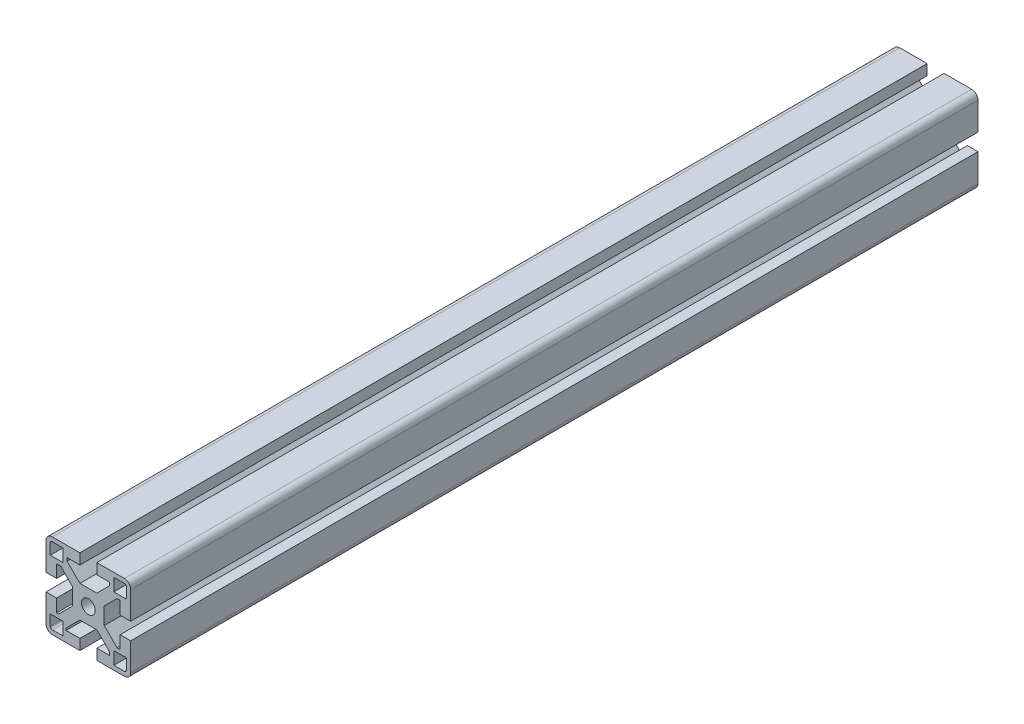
ISO-10303-21;
HEADER;
FILE_DESCRIPTION(('STEP AP214'),'2;1');
FILE_NAME('part.step','',(''),(''),'','','');
FILE_SCHEMA(('AUTOMOTIVE_DESIGN { 1 0 10303 214 1 1 1 1 }'));
ENDSEC;
DATA;
#1=APPLICATION_CONTEXT('core data for automotive mechanical design processes');
#2=APPLICATION_PROTOCOL_DEFINITION('international standard','automotive_design',2000,#1);
#3=PRODUCT_CONTEXT('',#1,'mechanical');
#4=PRODUCT('Part','Part','',(#3));
#5=PRODUCT_RELATED_PRODUCT_CATEGORY('part','',(#4));
#6=PRODUCT_DEFINITION_FORMATION('','',#4);
#7=PRODUCT_DEFINITION_CONTEXT('part definition',#1,'design');
#8=PRODUCT_DEFINITION('design','',#6,#7);
#9=PRODUCT_DEFINITION_SHAPE('','',#8);
#10=(LENGTH_UNIT() NAMED_UNIT(*) SI_UNIT(.MILLI.,.METRE.));
#11=(NAMED_UNIT(*) PLANE_ANGLE_UNIT() SI_UNIT($,.RADIAN.));
#12=(NAMED_UNIT(*) SI_UNIT($,.STERADIAN.) SOLID_ANGLE_UNIT());
#13=UNCERTAINTY_MEASURE_WITH_UNIT(LENGTH_MEASURE(1.E-05),#10,'distance_accuracy_value','');
#14=(GEOMETRIC_REPRESENTATION_CONTEXT(3) GLOBAL_UNCERTAINTY_ASSIGNED_CONTEXT((#13)) GLOBAL_UNIT_ASSIGNED_CONTEXT((#10,
#11,#12)) REPRESENTATION_CONTEXT('',''));
#15=CARTESIAN_POINT('',(0.,0.,0.));
#16=DIRECTION('',(0.,0.,1.));
#17=DIRECTION('',(1.,0.,0.));
#18=AXIS2_PLACEMENT_3D('',#15,#16,#17);
#19=CARTESIAN_POINT('',(-17.,17.,400.));
#20=DIRECTION('',(0.,0.,-1.));
#21=DIRECTION('',(-1.,0.,0.));
#22=AXIS2_PLACEMENT_3D('',#19,#20,#21);
#23=PLANE('',#22);
#24=DIRECTION('',(0.,1.,0.));
#25=VECTOR('',#24,1.);
#26=CARTESIAN_POINT('',(18.,-17.,400.));
#27=LINE('',#26,#25);
#28=CARTESIAN_POINT('',(18.,-17.,400.));
#29=VERTEX_POINT('',#28);
#30=CARTESIAN_POINT('',(18.,-12.,400.));
#31=VERTEX_POINT('',#30);
#32=EDGE_CURVE('E455',#29,#31,#27,.T.);
#33=ORIENTED_EDGE('',*,*,#32,.F.);
#34=CARTESIAN_POINT('',(17.,-17.,400.));
#35=DIRECTION('',(0.,0.,1.));
#36=DIRECTION('',(1.,0.,0.));
#37=AXIS2_PLACEMENT_3D('',#34,#35,#36);
#38=CIRCLE('',#37,1.);
#39=CARTESIAN_POINT('',(17.,-18.,400.));
#40=VERTEX_POINT('',#39);
#41=EDGE_CURVE('E484',#40,#29,#38,.T.);
#42=ORIENTED_EDGE('',*,*,#41,.F.);
#43=DIRECTION('',(1.,0.,0.));
#44=VECTOR('',#43,1.);
#45=CARTESIAN_POINT('',(17.,-18.,400.));
#46=LINE('',#45,#44);
#47=CARTESIAN_POINT('',(12.,-18.,400.));
#48=VERTEX_POINT('',#47);
#49=EDGE_CURVE('E479',#48,#40,#46,.T.);
#50=ORIENTED_EDGE('',*,*,#49,.F.);
#51=DIRECTION('',(0.,-1.,0.));
#52=VECTOR('',#51,1.);
#53=CARTESIAN_POINT('',(12.,-18.,400.));
#54=LINE('',#53,#52);
#55=CARTESIAN_POINT('',(12.,-12.,400.));
#56=VERTEX_POINT('',#55);
#57=EDGE_CURVE('E477',#56,#48,#54,.T.);
#58=ORIENTED_EDGE('',*,*,#57,.F.);
#59=DIRECTION('',(-1.,0.,0.));
#60=VECTOR('',#59,1.);
#61=CARTESIAN_POINT('',(18.,-12.,400.));
#62=LINE('',#61,#60);
#63=EDGE_CURVE('E463',#31,#56,#62,.T.);
#64=ORIENTED_EDGE('',*,*,#63,.F.);
#65=EDGE_LOOP('',(#33,#42,#50,#58,#64));
#66=FACE_BOUND('',#65,.T.);
#67=DIRECTION('',(0.,-1.,0.));
#68=VECTOR('',#67,1.);
#69=CARTESIAN_POINT('',(12.,12.,400.));
#70=LINE('',#69,#68);
#71=CARTESIAN_POINT('',(12.,18.,400.));
#72=VERTEX_POINT('',#71);
#73=CARTESIAN_POINT('',(12.,12.,400.));
#74=VERTEX_POINT('',#73);
#75=EDGE_CURVE('E540',#72,#74,#70,.T.);
#76=ORIENTED_EDGE('',*,*,#75,.F.);
#77=DIRECTION('',(-1.,0.,0.));
#78=VECTOR('',#77,1.);
#79=CARTESIAN_POINT('',(12.,18.,400.));
#80=LINE('',#79,#78);
#81=CARTESIAN_POINT('',(17.,18.,400.));
#82=VERTEX_POINT('',#81);
#83=EDGE_CURVE('E550',#82,#72,#80,.T.);
#84=ORIENTED_EDGE('',*,*,#83,.F.);
#85=CARTESIAN_POINT('',(17.,17.,400.));
#86=DIRECTION('',(0.,0.,1.));
#87=DIRECTION('',(1.,0.,0.));
#88=AXIS2_PLACEMENT_3D('',#85,#86,#87);
#89=CIRCLE('',#88,1.);
#90=CARTESIAN_POINT('',(18.,17.,400.));
#91=VERTEX_POINT('',#90);
#92=EDGE_CURVE('E547',#91,#82,#89,.T.);
#93=ORIENTED_EDGE('',*,*,#92,.F.);
#94=DIRECTION('',(0.,1.,0.));
#95=VECTOR('',#94,1.);
#96=CARTESIAN_POINT('',(18.,12.,400.));
#97=LINE('',#96,#95);
#98=CARTESIAN_POINT('',(18.,12.,400.));
#99=VERTEX_POINT('',#98);
#100=EDGE_CURVE('E545',#99,#91,#97,.T.);
#101=ORIENTED_EDGE('',*,*,#100,.F.);
#102=DIRECTION('',(1.,0.,0.));
#103=VECTOR('',#102,1.);
#104=CARTESIAN_POINT('',(12.,12.,400.));
#105=LINE('',#104,#103);
#106=EDGE_CURVE('E542',#74,#99,#105,.T.);
#107=ORIENTED_EDGE('',*,*,#106,.F.);
#108=EDGE_LOOP('',(#76,#84,#93,#101,#107));
#109=FACE_BOUND('',#108,.T.);
#110=CARTESIAN_POINT('',(-17.,17.,400.));
#111=DIRECTION('',(0.,0.,1.));
#112=DIRECTION('',(-1.,0.,0.));
#113=AXIS2_PLACEMENT_3D('',#110,#111,#112);
#114=CIRCLE('',#113,3.);
#115=CARTESIAN_POINT('',(-17.,20.,400.));
#116=VERTEX_POINT('',#115);
#117=CARTESIAN_POINT('',(-20.,17.,400.));
#118=VERTEX_POINT('',#117);
#119=EDGE_CURVE('E616',#116,#118,#114,.T.);
#120=ORIENTED_EDGE('',*,*,#119,.T.);
#121=DIRECTION('',(0.,-1.,0.));
#122=VECTOR('',#121,1.);
#123=CARTESIAN_POINT('',(-20.,3.99999999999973,400.));
#124=LINE('',#123,#122);
#125=CARTESIAN_POINT('',(-20.,3.99999999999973,400.));
#126=VERTEX_POINT('',#125);
#127=EDGE_CURVE('E619',#118,#126,#124,.T.);
#128=ORIENTED_EDGE('',*,*,#127,.T.);
#129=DIRECTION('',(1.,0.,0.));
#130=VECTOR('',#129,1.);
#131=CARTESIAN_POINT('',(-20.,3.99999999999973,400.));
#132=LINE('',#131,#130);
#133=CARTESIAN_POINT('',(-15.0000000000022,3.99999999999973,400.));
#134=VERTEX_POINT('',#133);
#135=EDGE_CURVE('E622',#126,#134,#132,.T.);
#136=ORIENTED_EDGE('',*,*,#135,.T.);
#137=DIRECTION('',(0.,1.,0.));
#138=VECTOR('',#137,1.);
#139=CARTESIAN_POINT('',(-15.0000000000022,3.99999999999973,400.));
#140=LINE('',#139,#138);
#141=CARTESIAN_POINT('',(-15.0000000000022,10.0499999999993,400.));
#142=VERTEX_POINT('',#141);
#143=EDGE_CURVE('E624',#134,#142,#140,.T.);
#144=ORIENTED_EDGE('',*,*,#143,.T.);
#145=DIRECTION('',(1.,0.,0.));
#146=VECTOR('',#145,1.);
#147=CARTESIAN_POINT('',(-15.0000000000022,10.0499999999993,400.));
#148=LINE('',#147,#146);
#149=CARTESIAN_POINT('',(-13.0999999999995,10.0499999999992,400.));
#150=VERTEX_POINT('',#149);
#151=EDGE_CURVE('E626',#142,#150,#148,.T.);
#152=ORIENTED_EDGE('',*,*,#151,.T.);
#153=DIRECTION('',(0.707106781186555,-0.70710678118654,0.));
#154=VECTOR('',#153,1.);
#155=CARTESIAN_POINT('',(-7.49999999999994,4.44999999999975,400.));
#156=LINE('',#155,#154);
#157=CARTESIAN_POINT('',(-7.49999999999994,4.44999999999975,400.));
#158=VERTEX_POINT('',#157);
#159=EDGE_CURVE('E628',#150,#158,#156,.T.);
#160=ORIENTED_EDGE('',*,*,#159,.T.);
#161=DIRECTION('',(0.,-1.,0.));
#162=VECTOR('',#161,1.);
#163=CARTESIAN_POINT('',(-7.49999999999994,-3.55000000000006,400.));
#164=LINE('',#163,#162);
#165=CARTESIAN_POINT('',(-7.49999999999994,-3.55000000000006,400.));
#166=VERTEX_POINT('',#165);
#167=EDGE_CURVE('E630',#158,#166,#164,.T.);
#168=ORIENTED_EDGE('',*,*,#167,.T.);
#169=DIRECTION('',(-0.70710678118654,-0.707106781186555,0.));
#170=VECTOR('',#169,1.);
#171=CARTESIAN_POINT('',(-7.49999999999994,-3.55000000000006,400.));
#172=LINE('',#171,#170);
#173=CARTESIAN_POINT('',(-13.9999999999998,-10.05,400.));
#174=VERTEX_POINT('',#173);
#175=EDGE_CURVE('E632',#166,#174,#172,.T.);
#176=ORIENTED_EDGE('',*,*,#175,.T.);
#177=DIRECTION('',(-1.,0.,0.));
#178=VECTOR('',#177,1.);
#179=CARTESIAN_POINT('',(-15.0000000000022,-10.05,400.));
#180=LINE('',#179,#178);
#181=CARTESIAN_POINT('',(-15.0000000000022,-10.05,400.));
#182=VERTEX_POINT('',#181);
#183=EDGE_CURVE('E634',#174,#182,#180,.T.);
#184=ORIENTED_EDGE('',*,*,#183,.T.);
#185=DIRECTION('',(0.,1.,0.));
#186=VECTOR('',#185,1.);
#187=CARTESIAN_POINT('',(-15.0000000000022,-10.05,400.));
#188=LINE('',#187,#186);
#189=CARTESIAN_POINT('',(-15.0000000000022,-4.00000000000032,400.));
#190=VERTEX_POINT('',#189);
#191=EDGE_CURVE('E636',#182,#190,#188,.T.);
#192=ORIENTED_EDGE('',*,*,#191,.T.);
#193=DIRECTION('',(-1.,0.,0.));
#194=VECTOR('',#193,1.);
#195=CARTESIAN_POINT('',(-20.,-4.00000000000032,400.));
#196=LINE('',#195,#194);
#197=CARTESIAN_POINT('',(-20.,-4.00000000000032,400.));
#198=VERTEX_POINT('',#197);
#199=EDGE_CURVE('E638',#190,#198,#196,.T.);
#200=ORIENTED_EDGE('',*,*,#199,.T.);
#201=DIRECTION('',(0.,-1.,0.));
#202=VECTOR('',#201,1.);
#203=CARTESIAN_POINT('',(-20.,-17.,400.));
#204=LINE('',#203,#202);
#205=CARTESIAN_POINT('',(-20.,-17.,400.));
#206=VERTEX_POINT('',#205);
#207=EDGE_CURVE('E640',#198,#206,#204,.T.);
#208=ORIENTED_EDGE('',*,*,#207,.T.);
#209=CARTESIAN_POINT('',(-17.,-17.,400.));
#210=DIRECTION('',(0.,0.,1.));
#211=DIRECTION('',(-1.,0.,0.));
#212=AXIS2_PLACEMENT_3D('',#209,#210,#211);
#213=CIRCLE('',#212,3.);
#214=CARTESIAN_POINT('',(-17.,-20.,400.));
#215=VERTEX_POINT('',#214);
#216=EDGE_CURVE('E642',#206,#215,#213,.T.);
#217=ORIENTED_EDGE('',*,*,#216,.T.);
#218=DIRECTION('',(1.,0.,0.));
#219=VECTOR('',#218,1.);
#220=CARTESIAN_POINT('',(-17.,-20.,400.));
#221=LINE('',#220,#219);
#222=CARTESIAN_POINT('',(-4.,-20.,400.));
#223=VERTEX_POINT('',#222);
#224=EDGE_CURVE('E644',#215,#223,#221,.T.);
#225=ORIENTED_EDGE('',*,*,#224,.T.);
#226=DIRECTION('',(0.,1.,0.));
#227=VECTOR('',#226,1.);
#228=CARTESIAN_POINT('',(-4.,-20.,400.));
#229=LINE('',#228,#227);
#230=CARTESIAN_POINT('',(-4.,-15.,400.));
#231=VERTEX_POINT('',#230);
#232=EDGE_CURVE('E646',#223,#231,#229,.T.);
#233=ORIENTED_EDGE('',*,*,#232,.T.);
#234=DIRECTION('',(-1.,0.,0.));
#235=VECTOR('',#234,1.);
#236=CARTESIAN_POINT('',(-10.4999999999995,-14.9999999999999,400.));
#237=LINE('',#236,#235);
#238=CARTESIAN_POINT('',(-10.4999999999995,-14.9999999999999,400.));
#239=VERTEX_POINT('',#238);
#240=EDGE_CURVE('E648',#231,#239,#237,.T.);
#241=ORIENTED_EDGE('',*,*,#240,.T.);
#242=DIRECTION('',(0.,1.,0.));
#243=VECTOR('',#242,1.);
#244=CARTESIAN_POINT('',(-10.4999999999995,-13.9999999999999,400.));
#245=LINE('',#244,#243);
#246=CARTESIAN_POINT('',(-10.4999999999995,-13.9999999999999,400.));
#247=VERTEX_POINT('',#246);
#248=EDGE_CURVE('E650',#239,#247,#245,.T.);
#249=ORIENTED_EDGE('',*,*,#248,.T.);
#250=DIRECTION('',(0.707106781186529,0.707106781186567,0.));
#251=VECTOR('',#250,1.);
#252=CARTESIAN_POINT('',(-10.4999999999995,-13.9999999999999,400.));
#253=LINE('',#252,#251);
#254=CARTESIAN_POINT('',(-4.,-7.5,400.));
#255=VERTEX_POINT('',#254);
#256=EDGE_CURVE('E652',#247,#255,#253,.T.);
#257=ORIENTED_EDGE('',*,*,#256,.T.);
#258=DIRECTION('',(1.,0.,0.));
#259=VECTOR('',#258,1.);
#260=CARTESIAN_POINT('',(-4.,-7.5,400.));
#261=LINE('',#260,#259);
#262=CARTESIAN_POINT('',(4.,-7.5,400.));
#263=VERTEX_POINT('',#262);
#264=EDGE_CURVE('E654',#255,#263,#261,.T.);
#265=ORIENTED_EDGE('',*,*,#264,.T.);
#266=DIRECTION('',(0.707106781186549,-0.707106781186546,0.));
#267=VECTOR('',#266,1.);
#268=CARTESIAN_POINT('',(4.,-7.5,400.));
#269=LINE('',#268,#267);
#270=CARTESIAN_POINT('',(10.0499999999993,-13.5499999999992,400.));
#271=VERTEX_POINT('',#270);
#272=EDGE_CURVE('E656',#263,#271,#269,.T.);
#273=ORIENTED_EDGE('',*,*,#272,.T.);
#274=DIRECTION('',(0.,-1.,0.));
#275=VECTOR('',#274,1.);
#276=CARTESIAN_POINT('',(10.0499999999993,-15.,400.));
#277=LINE('',#276,#275);
#278=CARTESIAN_POINT('',(10.0499999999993,-15.,400.));
#279=VERTEX_POINT('',#278);
#280=EDGE_CURVE('E658',#271,#279,#277,.T.);
#281=ORIENTED_EDGE('',*,*,#280,.T.);
#282=DIRECTION('',(-1.,0.,0.));
#283=VECTOR('',#282,1.);
#284=CARTESIAN_POINT('',(4.,-15.,400.));
#285=LINE('',#284,#283);
#286=CARTESIAN_POINT('',(4.,-15.,400.));
#287=VERTEX_POINT('',#286);
#288=EDGE_CURVE('E660',#279,#287,#285,.T.);
#289=ORIENTED_EDGE('',*,*,#288,.T.);
#290=DIRECTION('',(0.,-1.,0.));
#291=VECTOR('',#290,1.);
#292=CARTESIAN_POINT('',(4.,-20.,400.));
#293=LINE('',#292,#291);
#294=CARTESIAN_POINT('',(4.,-20.,400.));
#295=VERTEX_POINT('',#294);
#296=EDGE_CURVE('E662',#287,#295,#293,.T.);
#297=ORIENTED_EDGE('',*,*,#296,.T.);
#298=DIRECTION('',(1.,0.,0.));
#299=VECTOR('',#298,1.);
#300=CARTESIAN_POINT('',(17.,-20.,400.));
#301=LINE('',#300,#299);
#302=CARTESIAN_POINT('',(17.,-20.,400.));
#303=VERTEX_POINT('',#302);
#304=EDGE_CURVE('E664',#295,#303,#301,.T.);
#305=ORIENTED_EDGE('',*,*,#304,.T.);
#306=CARTESIAN_POINT('',(17.,-17.,400.));
#307=DIRECTION('',(0.,0.,1.));
#308=DIRECTION('',(1.,0.,0.));
#309=AXIS2_PLACEMENT_3D('',#306,#307,#308);
#310=CIRCLE('',#309,3.);
#311=CARTESIAN_POINT('',(20.,-17.,400.));
#312=VERTEX_POINT('',#311);
#313=EDGE_CURVE('E666',#303,#312,#310,.T.);
#314=ORIENTED_EDGE('',*,*,#313,.T.);
#315=DIRECTION('',(0.,1.,0.));
#316=VECTOR('',#315,1.);
#317=CARTESIAN_POINT('',(20.,-17.,400.));
#318=LINE('',#317,#316);
#319=CARTESIAN_POINT('',(20.,-4.00000000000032,400.));
#320=VERTEX_POINT('',#319);
#321=EDGE_CURVE('E668',#312,#320,#318,.T.);
#322=ORIENTED_EDGE('',*,*,#321,.T.);
#323=DIRECTION('',(-1.,0.,0.));
#324=VECTOR('',#323,1.);
#325=CARTESIAN_POINT('',(20.,-4.00000000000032,400.));
#326=LINE('',#325,#324);
#327=CARTESIAN_POINT('',(15.,-4.00000000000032,400.));
#328=VERTEX_POINT('',#327);
#329=EDGE_CURVE('E670',#320,#328,#326,.T.);
#330=ORIENTED_EDGE('',*,*,#329,.T.);
#331=DIRECTION('',(0.,-1.,0.));
#332=VECTOR('',#331,1.);
#333=CARTESIAN_POINT('',(15.,-10.05,400.));
#334=LINE('',#333,#332);
#335=CARTESIAN_POINT('',(15.,-10.05,400.));
#336=VERTEX_POINT('',#335);
#337=EDGE_CURVE('E672',#328,#336,#334,.T.);
#338=ORIENTED_EDGE('',*,*,#337,.T.);
#339=DIRECTION('',(-1.,0.,0.));
#340=VECTOR('',#339,1.);
#341=CARTESIAN_POINT('',(13.5499999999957,-10.05,400.));
#342=LINE('',#341,#340);
#343=CARTESIAN_POINT('',(13.5499999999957,-10.05,400.));
#344=VERTEX_POINT('',#343);
#345=EDGE_CURVE('E674',#336,#344,#342,.T.);
#346=ORIENTED_EDGE('',*,*,#345,.T.);
#347=DIRECTION('',(-0.707106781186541,0.707106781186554,0.));
#348=VECTOR('',#347,1.);
#349=CARTESIAN_POINT('',(7.4999999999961,-4.00000000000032,400.));
#350=LINE('',#349,#348);
#351=CARTESIAN_POINT('',(7.4999999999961,-4.00000000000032,400.));
#352=VERTEX_POINT('',#351);
#353=EDGE_CURVE('E676',#344,#352,#350,.T.);
#354=ORIENTED_EDGE('',*,*,#353,.T.);
#355=DIRECTION('',(0.,1.,0.));
#356=VECTOR('',#355,1.);
#357=CARTESIAN_POINT('',(7.4999999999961,-4.00000000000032,400.));
#358=LINE('',#357,#356);
#359=CARTESIAN_POINT('',(7.4999999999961,3.99999999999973,400.));
#360=VERTEX_POINT('',#359);
#361=EDGE_CURVE('E678',#352,#360,#358,.T.);
#362=ORIENTED_EDGE('',*,*,#361,.T.);
#363=DIRECTION('',(0.707106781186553,0.707106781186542,0.));
#364=VECTOR('',#363,1.);
#365=CARTESIAN_POINT('',(7.4999999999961,3.99999999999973,400.));
#366=LINE('',#365,#364);
#367=CARTESIAN_POINT('',(13.5499999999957,10.0499999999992,400.));
#368=VERTEX_POINT('',#367);
#369=EDGE_CURVE('E680',#360,#368,#366,.T.);
#370=ORIENTED_EDGE('',*,*,#369,.T.);
#371=DIRECTION('',(1.,-1.17243379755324E-13,0.));
#372=VECTOR('',#371,1.);
#373=CARTESIAN_POINT('',(13.5499999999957,10.0499999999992,400.));
#374=LINE('',#373,#372);
#375=CARTESIAN_POINT('',(15.,10.049999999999,400.));
#376=VERTEX_POINT('',#375);
#377=EDGE_CURVE('E682',#368,#376,#374,.T.);
#378=ORIENTED_EDGE('',*,*,#377,.T.);
#379=DIRECTION('',(0.,-1.,0.));
#380=VECTOR('',#379,1.);
#381=CARTESIAN_POINT('',(15.,3.99999999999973,400.));
#382=LINE('',#381,#380);
#383=CARTESIAN_POINT('',(15.,3.99999999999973,400.));
#384=VERTEX_POINT('',#383);
#385=EDGE_CURVE('E684',#376,#384,#382,.T.);
#386=ORIENTED_EDGE('',*,*,#385,.T.);
#387=DIRECTION('',(1.,0.,0.));
#388=VECTOR('',#387,1.);
#389=CARTESIAN_POINT('',(20.,3.99999999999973,400.));
#390=LINE('',#389,#388);
#391=CARTESIAN_POINT('',(20.,3.99999999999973,400.));
#392=VERTEX_POINT('',#391);
#393=EDGE_CURVE('E686',#384,#392,#390,.T.);
#394=ORIENTED_EDGE('',*,*,#393,.T.);
#395=DIRECTION('',(0.,1.,0.));
#396=VECTOR('',#395,1.);
#397=CARTESIAN_POINT('',(20.,3.99999999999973,400.));
#398=LINE('',#397,#396);
#399=CARTESIAN_POINT('',(20.,17.,400.));
#400=VERTEX_POINT('',#399);
#401=EDGE_CURVE('E688',#392,#400,#398,.T.);
#402=ORIENTED_EDGE('',*,*,#401,.T.);
#403=CARTESIAN_POINT('',(17.,17.,400.));
#404=DIRECTION('',(0.,0.,1.));
#405=DIRECTION('',(-1.,0.,0.));
#406=AXIS2_PLACEMENT_3D('',#403,#404,#405);
#407=CIRCLE('',#406,3.);
#408=CARTESIAN_POINT('',(17.,20.,400.));
#409=VERTEX_POINT('',#408);
#410=EDGE_CURVE('E690',#400,#409,#407,.T.);
#411=ORIENTED_EDGE('',*,*,#410,.T.);
#412=DIRECTION('',(-1.,0.,0.));
#413=VECTOR('',#412,1.);
#414=CARTESIAN_POINT('',(4.00000000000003,20.,400.));
#415=LINE('',#414,#413);
#416=CARTESIAN_POINT('',(4.00000000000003,20.,400.));
#417=VERTEX_POINT('',#416);
#418=EDGE_CURVE('E692',#409,#417,#415,.T.);
#419=ORIENTED_EDGE('',*,*,#418,.T.);
#420=DIRECTION('',(0.,-1.,0.));
#421=VECTOR('',#420,1.);
#422=CARTESIAN_POINT('',(4.00000000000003,20.,400.));
#423=LINE('',#422,#421);
#424=CARTESIAN_POINT('',(4.00000000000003,15.,400.));
#425=VERTEX_POINT('',#424);
#426=EDGE_CURVE('E694',#417,#425,#423,.T.);
#427=ORIENTED_EDGE('',*,*,#426,.T.);
#428=DIRECTION('',(1.,0.,0.));
#429=VECTOR('',#428,1.);
#430=CARTESIAN_POINT('',(4.00000000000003,15.,400.));
#431=LINE('',#430,#429);
#432=CARTESIAN_POINT('',(10.0499999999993,15.,400.));
#433=VERTEX_POINT('',#432);
#434=EDGE_CURVE('E696',#425,#433,#431,.T.);
#435=ORIENTED_EDGE('',*,*,#434,.T.);
#436=DIRECTION('',(0.,-1.,0.));
#437=VECTOR('',#436,1.);
#438=CARTESIAN_POINT('',(10.0499999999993,13.5499999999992,400.));
#439=LINE('',#438,#437);
#440=CARTESIAN_POINT('',(10.0499999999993,13.5499999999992,400.));
#441=VERTEX_POINT('',#440);
#442=EDGE_CURVE('E698',#433,#441,#439,.T.);
#443=ORIENTED_EDGE('',*,*,#442,.T.);
#444=DIRECTION('',(-0.707106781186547,-0.707106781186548,0.));
#445=VECTOR('',#444,1.);
#446=CARTESIAN_POINT('',(4.00000000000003,7.5,400.));
#447=LINE('',#446,#445);
#448=CARTESIAN_POINT('',(4.00000000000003,7.5,400.));
#449=VERTEX_POINT('',#448);
#450=EDGE_CURVE('E700',#441,#449,#447,.T.);
#451=ORIENTED_EDGE('',*,*,#450,.T.);
#452=DIRECTION('',(-1.,0.,0.));
#453=VECTOR('',#452,1.);
#454=CARTESIAN_POINT('',(-3.99999999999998,7.5,400.));
#455=LINE('',#454,#453);
#456=CARTESIAN_POINT('',(-3.99999999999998,7.5,400.));
#457=VERTEX_POINT('',#456);
#458=EDGE_CURVE('E702',#449,#457,#455,.T.);
#459=ORIENTED_EDGE('',*,*,#458,.T.);
#460=DIRECTION('',(-0.707857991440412,0.706354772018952,0.));
#461=VECTOR('',#460,1.);
#462=CARTESIAN_POINT('',(-10.0628752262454,13.5499999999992,400.));
#463=LINE('',#462,#461);
#464=CARTESIAN_POINT('',(-10.0628752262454,13.5499999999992,400.));
#465=VERTEX_POINT('',#464);
#466=EDGE_CURVE('E704',#457,#465,#463,.T.);
#467=ORIENTED_EDGE('',*,*,#466,.T.);
#468=DIRECTION('',(0.,1.,0.));
#469=VECTOR('',#468,1.);
#470=CARTESIAN_POINT('',(-10.0628752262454,13.5499999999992,400.));
#471=LINE('',#470,#469);
#472=CARTESIAN_POINT('',(-10.0628752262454,15.,400.));
#473=VERTEX_POINT('',#472);
#474=EDGE_CURVE('E706',#465,#473,#471,.T.);
#475=ORIENTED_EDGE('',*,*,#474,.T.);
#476=DIRECTION('',(1.,0.,0.));
#477=VECTOR('',#476,1.);
#478=CARTESIAN_POINT('',(-10.0628752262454,15.,400.));
#479=LINE('',#478,#477);
#480=CARTESIAN_POINT('',(-3.99999999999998,15.,400.));
#481=VERTEX_POINT('',#480);
#482=EDGE_CURVE('E708',#473,#481,#479,.T.);
#483=ORIENTED_EDGE('',*,*,#482,.T.);
#484=DIRECTION('',(0.,1.,0.));
#485=VECTOR('',#484,1.);
#486=CARTESIAN_POINT('',(-3.99999999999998,20.,400.));
#487=LINE('',#486,#485);
#488=CARTESIAN_POINT('',(-3.99999999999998,20.,400.));
#489=VERTEX_POINT('',#488);
#490=EDGE_CURVE('E710',#481,#489,#487,.T.);
#491=ORIENTED_EDGE('',*,*,#490,.T.);
#492=DIRECTION('',(-1.,0.,0.));
#493=VECTOR('',#492,1.);
#494=CARTESIAN_POINT('',(-17.,20.,400.));
#495=LINE('',#494,#493);
#496=EDGE_CURVE('E712',#489,#116,#495,.T.);
#497=ORIENTED_EDGE('',*,*,#496,.T.);
#498=EDGE_LOOP('',(#120,#128,#136,#144,#152,#160,#168,#176,#184,#192,#200,#208,#217,#225,#233,
#241,#249,#257,#265,#273,#281,#289,#297,#305,#314,#322,#330,#338,#346,#354,#362,#370,#378,#386,
#394,#402,#411,#419,#427,#435,#443,#451,#459,#467,#475,#483,#491,#497));
#499=FACE_BOUND('',#498,.T.);
#500=DIRECTION('',(0.,1.,0.));
#501=VECTOR('',#500,1.);
#502=CARTESIAN_POINT('',(-12.,12.,400.));
#503=LINE('',#502,#501);
#504=CARTESIAN_POINT('',(-12.,12.,400.));
#505=VERTEX_POINT('',#504);
#506=CARTESIAN_POINT('',(-12.,18.,400.));
#507=VERTEX_POINT('',#506);
#508=EDGE_CURVE('E578',#505,#507,#503,.T.);
#509=ORIENTED_EDGE('',*,*,#508,.F.);
#510=DIRECTION('',(1.,0.,0.));
#511=VECTOR('',#510,1.);
#512=CARTESIAN_POINT('',(-18.,12.,400.));
#513=LINE('',#512,#511);
#514=CARTESIAN_POINT('',(-18.,12.,400.));
#515=VERTEX_POINT('',#514);
#516=EDGE_CURVE('E588',#515,#505,#513,.T.);
#517=ORIENTED_EDGE('',*,*,#516,.F.);
#518=DIRECTION('',(0.,-1.,0.));
#519=VECTOR('',#518,1.);
#520=CARTESIAN_POINT('',(-18.,12.,400.));
#521=LINE('',#520,#519);
#522=CARTESIAN_POINT('',(-18.,17.,400.));
#523=VERTEX_POINT('',#522);
#524=EDGE_CURVE('E585',#523,#515,#521,.T.);
#525=ORIENTED_EDGE('',*,*,#524,.F.);
#526=CARTESIAN_POINT('',(-17.,17.,400.));
#527=DIRECTION('',(0.,0.,1.));
#528=DIRECTION('',(-1.,0.,0.));
#529=AXIS2_PLACEMENT_3D('',#526,#527,#528);
#530=CIRCLE('',#529,1.);
#531=CARTESIAN_POINT('',(-17.,18.,400.));
#532=VERTEX_POINT('',#531);
#533=EDGE_CURVE('E583',#532,#523,#530,.T.);
#534=ORIENTED_EDGE('',*,*,#533,.F.);
#535=DIRECTION('',(-1.,0.,0.));
#536=VECTOR('',#535,1.);
#537=CARTESIAN_POINT('',(-17.,18.,400.));
#538=LINE('',#537,#536);
#539=EDGE_CURVE('E580',#507,#532,#538,.T.);
#540=ORIENTED_EDGE('',*,*,#539,.F.);
#541=EDGE_LOOP('',(#509,#517,#525,#534,#540));
#542=FACE_BOUND('',#541,.T.);
#543=DIRECTION('',(0.,1.,0.));
#544=VECTOR('',#543,1.);
#545=CARTESIAN_POINT('',(-12.,-18.,400.));
#546=LINE('',#545,#544);
#547=CARTESIAN_POINT('',(-12.,-18.,400.));
#548=VERTEX_POINT('',#547);
#549=CARTESIAN_POINT('',(-12.,-12.,400.));
#550=VERTEX_POINT('',#549);
#551=EDGE_CURVE('E502',#548,#550,#546,.T.);
#552=ORIENTED_EDGE('',*,*,#551,.F.);
#553=DIRECTION('',(1.,0.,0.));
#554=VECTOR('',#553,1.);
#555=CARTESIAN_POINT('',(-17.,-18.,400.));
#556=LINE('',#555,#554);
#557=CARTESIAN_POINT('',(-17.,-18.,400.));
#558=VERTEX_POINT('',#557);
#559=EDGE_CURVE('E512',#558,#548,#556,.T.);
#560=ORIENTED_EDGE('',*,*,#559,.F.);
#561=CARTESIAN_POINT('',(-17.,-17.,400.));
#562=DIRECTION('',(0.,0.,1.));
#563=DIRECTION('',(1.,0.,0.));
#564=AXIS2_PLACEMENT_3D('',#561,#562,#563);
#565=CIRCLE('',#564,1.);
#566=CARTESIAN_POINT('',(-18.,-17.,400.));
#567=VERTEX_POINT('',#566);
#568=EDGE_CURVE('E509',#567,#558,#565,.T.);
#569=ORIENTED_EDGE('',*,*,#568,.F.);
#570=DIRECTION('',(0.,-1.,0.));
#571=VECTOR('',#570,1.);
#572=CARTESIAN_POINT('',(-18.,-17.,400.));
#573=LINE('',#572,#571);
#574=CARTESIAN_POINT('',(-18.,-12.,400.));
#575=VERTEX_POINT('',#574);
#576=EDGE_CURVE('E507',#575,#567,#573,.T.);
#577=ORIENTED_EDGE('',*,*,#576,.F.);
#578=DIRECTION('',(-1.,0.,0.));
#579=VECTOR('',#578,1.);
#580=CARTESIAN_POINT('',(-18.,-12.,400.));
#581=LINE('',#580,#579);
#582=EDGE_CURVE('E504',#550,#575,#581,.T.);
#583=ORIENTED_EDGE('',*,*,#582,.F.);
#584=EDGE_LOOP('',(#552,#560,#569,#577,#583));
#585=FACE_BOUND('',#584,.T.);
#586=CARTESIAN_POINT('',(0.,0.,400.));
#587=DIRECTION('',(0.,0.,1.));
#588=DIRECTION('',(1.,0.,0.));
#589=AXIS2_PLACEMENT_3D('',#586,#587,#588);
#590=CIRCLE('',#589,3.25);
#591=CARTESIAN_POINT('',(3.25,0.,400.));
#592=VERTEX_POINT('',#591);
#593=EDGE_CURVE('E487',#592,#592,#590,.T.);
#594=ORIENTED_EDGE('',*,*,#593,.F.);
#595=EDGE_LOOP('',(#594));
#596=FACE_BOUND('',#595,.T.);
#597=ADVANCED_FACE('F30',(#66,#109,#499,#542,#585,#596),#23,.F.);
#598=CARTESIAN_POINT('',(-17.,17.,0.));
#599=DIRECTION('',(0.,0.,-1.));
#600=DIRECTION('',(-1.,0.,0.));
#601=AXIS2_PLACEMENT_3D('',#598,#599,#600);
#602=PLANE('',#601);
#603=CARTESIAN_POINT('',(17.,-17.,0.));
#604=DIRECTION('',(0.,0.,1.));
#605=DIRECTION('',(1.,0.,0.));
#606=AXIS2_PLACEMENT_3D('',#603,#604,#605);
#607=CIRCLE('',#606,1.);
#608=CARTESIAN_POINT('',(17.,-18.,0.));
#609=VERTEX_POINT('',#608);
#610=CARTESIAN_POINT('',(18.,-17.,0.));
#611=VERTEX_POINT('',#610);
#612=EDGE_CURVE('E464',#609,#611,#607,.T.);
#613=ORIENTED_EDGE('',*,*,#612,.T.);
#614=DIRECTION('',(0.,1.,0.));
#615=VECTOR('',#614,1.);
#616=CARTESIAN_POINT('',(18.,-17.,0.));
#617=LINE('',#616,#615);
#618=CARTESIAN_POINT('',(18.,-12.,0.));
#619=VERTEX_POINT('',#618);
#620=EDGE_CURVE('E53',#611,#619,#617,.T.);
#621=ORIENTED_EDGE('',*,*,#620,.T.);
#622=DIRECTION('',(-1.,0.,0.));
#623=VECTOR('',#622,1.);
#624=CARTESIAN_POINT('',(18.,-12.,0.));
#625=LINE('',#624,#623);
#626=CARTESIAN_POINT('',(12.,-12.,0.));
#627=VERTEX_POINT('',#626);
#628=EDGE_CURVE('E470',#619,#627,#625,.T.);
#629=ORIENTED_EDGE('',*,*,#628,.T.);
#630=DIRECTION('',(0.,-1.,0.));
#631=VECTOR('',#630,1.);
#632=CARTESIAN_POINT('',(12.,-18.,0.));
#633=LINE('',#632,#631);
#634=CARTESIAN_POINT('',(12.,-18.,0.));
#635=VERTEX_POINT('',#634);
#636=EDGE_CURVE('E489',#627,#635,#633,.T.);
#637=ORIENTED_EDGE('',*,*,#636,.T.);
#638=DIRECTION('',(1.,0.,0.));
#639=VECTOR('',#638,1.);
#640=CARTESIAN_POINT('',(17.,-18.,0.));
#641=LINE('',#640,#639);
#642=EDGE_CURVE('E492',#635,#609,#641,.T.);
#643=ORIENTED_EDGE('',*,*,#642,.T.);
#644=EDGE_LOOP('',(#613,#621,#629,#637,#643));
#645=FACE_BOUND('',#644,.T.);
#646=DIRECTION('',(-1.,0.,0.));
#647=VECTOR('',#646,1.);
#648=CARTESIAN_POINT('',(12.,18.,0.));
#649=LINE('',#648,#647);
#650=CARTESIAN_POINT('',(17.,18.,0.));
#651=VERTEX_POINT('',#650);
#652=CARTESIAN_POINT('',(12.,18.,0.));
#653=VERTEX_POINT('',#652);
#654=EDGE_CURVE('E543',#651,#653,#649,.T.);
#655=ORIENTED_EDGE('',*,*,#654,.T.);
#656=DIRECTION('',(0.,-1.,0.));
#657=VECTOR('',#656,1.);
#658=CARTESIAN_POINT('',(12.,12.,0.));
#659=LINE('',#658,#657);
#660=CARTESIAN_POINT('',(12.,12.,0.));
#661=VERTEX_POINT('',#660);
#662=EDGE_CURVE('E539',#653,#661,#659,.T.);
#663=ORIENTED_EDGE('',*,*,#662,.T.);
#664=DIRECTION('',(1.,0.,0.));
#665=VECTOR('',#664,1.);
#666=CARTESIAN_POINT('',(12.,12.,0.));
#667=LINE('',#666,#665);
#668=CARTESIAN_POINT('',(18.,12.,0.));
#669=VERTEX_POINT('',#668);
#670=EDGE_CURVE('E555',#661,#669,#667,.T.);
#671=ORIENTED_EDGE('',*,*,#670,.T.);
#672=DIRECTION('',(0.,1.,0.));
#673=VECTOR('',#672,1.);
#674=CARTESIAN_POINT('',(18.,12.,0.));
#675=LINE('',#674,#673);
#676=CARTESIAN_POINT('',(18.,17.,0.));
#677=VERTEX_POINT('',#676);
#678=EDGE_CURVE('E558',#669,#677,#675,.T.);
#679=ORIENTED_EDGE('',*,*,#678,.T.);
#680=CARTESIAN_POINT('',(17.,17.,0.));
#681=DIRECTION('',(0.,0.,1.));
#682=DIRECTION('',(1.,0.,0.));
#683=AXIS2_PLACEMENT_3D('',#680,#681,#682);
#684=CIRCLE('',#683,1.);
#685=EDGE_CURVE('E561',#677,#651,#684,.T.);
#686=ORIENTED_EDGE('',*,*,#685,.T.);
#687=EDGE_LOOP('',(#655,#663,#671,#679,#686));
#688=FACE_BOUND('',#687,.T.);
#689=CARTESIAN_POINT('',(-17.,17.,0.));
#690=DIRECTION('',(0.,0.,1.));
#691=DIRECTION('',(-1.,0.,0.));
#692=AXIS2_PLACEMENT_3D('',#689,#690,#691);
#693=CIRCLE('',#692,3.);
#694=CARTESIAN_POINT('',(-17.,20.,0.));
#695=VERTEX_POINT('',#694);
#696=CARTESIAN_POINT('',(-20.,17.,0.));
#697=VERTEX_POINT('',#696);
#698=EDGE_CURVE('E615',#695,#697,#693,.T.);
#699=ORIENTED_EDGE('',*,*,#698,.F.);
#700=DIRECTION('',(-1.,0.,0.));
#701=VECTOR('',#700,1.);
#702=CARTESIAN_POINT('',(-17.,20.,0.));
#703=LINE('',#702,#701);
#704=CARTESIAN_POINT('',(-3.99999999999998,20.,0.));
#705=VERTEX_POINT('',#704);
#706=EDGE_CURVE('E620',#705,#695,#703,.T.);
#707=ORIENTED_EDGE('',*,*,#706,.F.);
#708=DIRECTION('',(0.,1.,0.));
#709=VECTOR('',#708,1.);
#710=CARTESIAN_POINT('',(-3.99999999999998,20.,0.));
#711=LINE('',#710,#709);
#712=CARTESIAN_POINT('',(-3.99999999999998,15.,0.));
#713=VERTEX_POINT('',#712);
#714=EDGE_CURVE('E807',#713,#705,#711,.T.);
#715=ORIENTED_EDGE('',*,*,#714,.F.);
#716=DIRECTION('',(1.,0.,0.));
#717=VECTOR('',#716,1.);
#718=CARTESIAN_POINT('',(-10.0628752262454,15.,0.));
#719=LINE('',#718,#717);
#720=CARTESIAN_POINT('',(-10.0628752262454,15.,0.));
#721=VERTEX_POINT('',#720);
#722=EDGE_CURVE('E805',#721,#713,#719,.T.);
#723=ORIENTED_EDGE('',*,*,#722,.F.);
#724=DIRECTION('',(0.,1.,0.));
#725=VECTOR('',#724,1.);
#726=CARTESIAN_POINT('',(-10.0628752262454,13.5499999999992,0.));
#727=LINE('',#726,#725);
#728=CARTESIAN_POINT('',(-10.0628752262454,13.5499999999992,0.));
#729=VERTEX_POINT('',#728);
#730=EDGE_CURVE('E803',#729,#721,#727,.T.);
#731=ORIENTED_EDGE('',*,*,#730,.F.);
#732=DIRECTION('',(-0.707857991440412,0.706354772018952,0.));
#733=VECTOR('',#732,1.);
#734=CARTESIAN_POINT('',(-10.0628752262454,13.5499999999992,0.));
#735=LINE('',#734,#733);
#736=CARTESIAN_POINT('',(-3.99999999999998,7.5,0.));
#737=VERTEX_POINT('',#736);
#738=EDGE_CURVE('E801',#737,#729,#735,.T.);
#739=ORIENTED_EDGE('',*,*,#738,.F.);
#740=DIRECTION('',(-1.,0.,0.));
#741=VECTOR('',#740,1.);
#742=CARTESIAN_POINT('',(-3.99999999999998,7.5,0.));
#743=LINE('',#742,#741);
#744=CARTESIAN_POINT('',(4.00000000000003,7.5,0.));
#745=VERTEX_POINT('',#744);
#746=EDGE_CURVE('E799',#745,#737,#743,.T.);
#747=ORIENTED_EDGE('',*,*,#746,.F.);
#748=DIRECTION('',(-0.707106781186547,-0.707106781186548,0.));
#749=VECTOR('',#748,1.);
#750=CARTESIAN_POINT('',(4.00000000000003,7.5,0.));
#751=LINE('',#750,#749);
#752=CARTESIAN_POINT('',(10.0499999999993,13.5499999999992,0.));
#753=VERTEX_POINT('',#752);
#754=EDGE_CURVE('E797',#753,#745,#751,.T.);
#755=ORIENTED_EDGE('',*,*,#754,.F.);
#756=DIRECTION('',(0.,-1.,0.));
#757=VECTOR('',#756,1.);
#758=CARTESIAN_POINT('',(10.0499999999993,13.5499999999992,0.));
#759=LINE('',#758,#757);
#760=CARTESIAN_POINT('',(10.0499999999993,15.,0.));
#761=VERTEX_POINT('',#760);
#762=EDGE_CURVE('E795',#761,#753,#759,.T.);
#763=ORIENTED_EDGE('',*,*,#762,.F.);
#764=DIRECTION('',(1.,0.,0.));
#765=VECTOR('',#764,1.);
#766=CARTESIAN_POINT('',(4.00000000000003,15.,0.));
#767=LINE('',#766,#765);
#768=CARTESIAN_POINT('',(4.00000000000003,15.,0.));
#769=VERTEX_POINT('',#768);
#770=EDGE_CURVE('E793',#769,#761,#767,.T.);
#771=ORIENTED_EDGE('',*,*,#770,.F.);
#772=DIRECTION('',(0.,-1.,0.));
#773=VECTOR('',#772,1.);
#774=CARTESIAN_POINT('',(4.00000000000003,20.,0.));
#775=LINE('',#774,#773);
#776=CARTESIAN_POINT('',(4.00000000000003,20.,0.));
#777=VERTEX_POINT('',#776);
#778=EDGE_CURVE('E791',#777,#769,#775,.T.);
#779=ORIENTED_EDGE('',*,*,#778,.F.);
#780=DIRECTION('',(-1.,0.,0.));
#781=VECTOR('',#780,1.);
#782=CARTESIAN_POINT('',(4.00000000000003,20.,0.));
#783=LINE('',#782,#781);
#784=CARTESIAN_POINT('',(17.,20.,0.));
#785=VERTEX_POINT('',#784);
#786=EDGE_CURVE('E789',#785,#777,#783,.T.);
#787=ORIENTED_EDGE('',*,*,#786,.F.);
#788=CARTESIAN_POINT('',(17.,17.,0.));
#789=DIRECTION('',(0.,0.,1.));
#790=DIRECTION('',(-1.,0.,0.));
#791=AXIS2_PLACEMENT_3D('',#788,#789,#790);
#792=CIRCLE('',#791,3.);
#793=CARTESIAN_POINT('',(20.,17.,0.));
#794=VERTEX_POINT('',#793);
#795=EDGE_CURVE('E787',#794,#785,#792,.T.);
#796=ORIENTED_EDGE('',*,*,#795,.F.);
#797=DIRECTION('',(0.,1.,0.));
#798=VECTOR('',#797,1.);
#799=CARTESIAN_POINT('',(20.,3.99999999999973,0.));
#800=LINE('',#799,#798);
#801=CARTESIAN_POINT('',(20.,3.99999999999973,0.));
#802=VERTEX_POINT('',#801);
#803=EDGE_CURVE('E785',#802,#794,#800,.T.);
#804=ORIENTED_EDGE('',*,*,#803,.F.);
#805=DIRECTION('',(1.,0.,0.));
#806=VECTOR('',#805,1.);
#807=CARTESIAN_POINT('',(20.,3.99999999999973,0.));
#808=LINE('',#807,#806);
#809=CARTESIAN_POINT('',(15.,3.99999999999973,0.));
#810=VERTEX_POINT('',#809);
#811=EDGE_CURVE('E783',#810,#802,#808,.T.);
#812=ORIENTED_EDGE('',*,*,#811,.F.);
#813=DIRECTION('',(0.,-1.,0.));
#814=VECTOR('',#813,1.);
#815=CARTESIAN_POINT('',(15.,3.99999999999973,0.));
#816=LINE('',#815,#814);
#817=CARTESIAN_POINT('',(15.,10.049999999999,0.));
#818=VERTEX_POINT('',#817);
#819=EDGE_CURVE('E781',#818,#810,#816,.T.);
#820=ORIENTED_EDGE('',*,*,#819,.F.);
#821=DIRECTION('',(1.,-1.17243379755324E-13,0.));
#822=VECTOR('',#821,1.);
#823=CARTESIAN_POINT('',(13.5499999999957,10.0499999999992,0.));
#824=LINE('',#823,#822);
#825=CARTESIAN_POINT('',(13.5499999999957,10.0499999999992,0.));
#826=VERTEX_POINT('',#825);
#827=EDGE_CURVE('E779',#826,#818,#824,.T.);
#828=ORIENTED_EDGE('',*,*,#827,.F.);
#829=DIRECTION('',(0.707106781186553,0.707106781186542,0.));
#830=VECTOR('',#829,1.);
#831=CARTESIAN_POINT('',(7.4999999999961,3.99999999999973,0.));
#832=LINE('',#831,#830);
#833=CARTESIAN_POINT('',(7.4999999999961,3.99999999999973,0.));
#834=VERTEX_POINT('',#833);
#835=EDGE_CURVE('E777',#834,#826,#832,.T.);
#836=ORIENTED_EDGE('',*,*,#835,.F.);
#837=DIRECTION('',(0.,1.,0.));
#838=VECTOR('',#837,1.);
#839=CARTESIAN_POINT('',(7.4999999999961,-4.00000000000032,0.));
#840=LINE('',#839,#838);
#841=CARTESIAN_POINT('',(7.4999999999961,-4.00000000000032,0.));
#842=VERTEX_POINT('',#841);
#843=EDGE_CURVE('E775',#842,#834,#840,.T.);
#844=ORIENTED_EDGE('',*,*,#843,.F.);
#845=DIRECTION('',(-0.707106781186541,0.707106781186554,0.));
#846=VECTOR('',#845,1.);
#847=CARTESIAN_POINT('',(7.4999999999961,-4.00000000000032,0.));
#848=LINE('',#847,#846);
#849=CARTESIAN_POINT('',(13.5499999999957,-10.05,0.));
#850=VERTEX_POINT('',#849);
#851=EDGE_CURVE('E773',#850,#842,#848,.T.);
#852=ORIENTED_EDGE('',*,*,#851,.F.);
#853=DIRECTION('',(-1.,0.,0.));
#854=VECTOR('',#853,1.);
#855=CARTESIAN_POINT('',(13.5499999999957,-10.05,0.));
#856=LINE('',#855,#854);
#857=CARTESIAN_POINT('',(15.,-10.05,0.));
#858=VERTEX_POINT('',#857);
#859=EDGE_CURVE('E771',#858,#850,#856,.T.);
#860=ORIENTED_EDGE('',*,*,#859,.F.);
#861=DIRECTION('',(0.,-1.,0.));
#862=VECTOR('',#861,1.);
#863=CARTESIAN_POINT('',(15.,-10.05,0.));
#864=LINE('',#863,#862);
#865=CARTESIAN_POINT('',(15.,-4.00000000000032,0.));
#866=VERTEX_POINT('',#865);
#867=EDGE_CURVE('E769',#866,#858,#864,.T.);
#868=ORIENTED_EDGE('',*,*,#867,.F.);
#869=DIRECTION('',(-1.,0.,0.));
#870=VECTOR('',#869,1.);
#871=CARTESIAN_POINT('',(20.,-4.00000000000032,0.));
#872=LINE('',#871,#870);
#873=CARTESIAN_POINT('',(20.,-4.00000000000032,0.));
#874=VERTEX_POINT('',#873);
#875=EDGE_CURVE('E767',#874,#866,#872,.T.);
#876=ORIENTED_EDGE('',*,*,#875,.F.);
#877=DIRECTION('',(0.,1.,0.));
#878=VECTOR('',#877,1.);
#879=CARTESIAN_POINT('',(20.,-17.,0.));
#880=LINE('',#879,#878);
#881=CARTESIAN_POINT('',(20.,-17.,0.));
#882=VERTEX_POINT('',#881);
#883=EDGE_CURVE('E765',#882,#874,#880,.T.);
#884=ORIENTED_EDGE('',*,*,#883,.F.);
#885=CARTESIAN_POINT('',(17.,-17.,0.));
#886=DIRECTION('',(0.,0.,1.));
#887=DIRECTION('',(1.,0.,0.));
#888=AXIS2_PLACEMENT_3D('',#885,#886,#887);
#889=CIRCLE('',#888,3.);
#890=CARTESIAN_POINT('',(17.,-20.,0.));
#891=VERTEX_POINT('',#890);
#892=EDGE_CURVE('E763',#891,#882,#889,.T.);
#893=ORIENTED_EDGE('',*,*,#892,.F.);
#894=DIRECTION('',(1.,0.,0.));
#895=VECTOR('',#894,1.);
#896=CARTESIAN_POINT('',(17.,-20.,0.));
#897=LINE('',#896,#895);
#898=CARTESIAN_POINT('',(4.,-20.,0.));
#899=VERTEX_POINT('',#898);
#900=EDGE_CURVE('E761',#899,#891,#897,.T.);
#901=ORIENTED_EDGE('',*,*,#900,.F.);
#902=DIRECTION('',(0.,-1.,0.));
#903=VECTOR('',#902,1.);
#904=CARTESIAN_POINT('',(4.,-20.,0.));
#905=LINE('',#904,#903);
#906=CARTESIAN_POINT('',(4.,-15.,0.));
#907=VERTEX_POINT('',#906);
#908=EDGE_CURVE('E759',#907,#899,#905,.T.);
#909=ORIENTED_EDGE('',*,*,#908,.F.);
#910=DIRECTION('',(-1.,0.,0.));
#911=VECTOR('',#910,1.);
#912=CARTESIAN_POINT('',(4.,-15.,0.));
#913=LINE('',#912,#911);
#914=CARTESIAN_POINT('',(10.0499999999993,-15.,0.));
#915=VERTEX_POINT('',#914);
#916=EDGE_CURVE('E757',#915,#907,#913,.T.);
#917=ORIENTED_EDGE('',*,*,#916,.F.);
#918=DIRECTION('',(0.,-1.,0.));
#919=VECTOR('',#918,1.);
#920=CARTESIAN_POINT('',(10.0499999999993,-15.,0.));
#921=LINE('',#920,#919);
#922=CARTESIAN_POINT('',(10.0499999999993,-13.5499999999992,0.));
#923=VERTEX_POINT('',#922);
#924=EDGE_CURVE('E755',#923,#915,#921,.T.);
#925=ORIENTED_EDGE('',*,*,#924,.F.);
#926=DIRECTION('',(0.707106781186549,-0.707106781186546,0.));
#927=VECTOR('',#926,1.);
#928=CARTESIAN_POINT('',(4.,-7.5,0.));
#929=LINE('',#928,#927);
#930=CARTESIAN_POINT('',(4.,-7.5,0.));
#931=VERTEX_POINT('',#930);
#932=EDGE_CURVE('E753',#931,#923,#929,.T.);
#933=ORIENTED_EDGE('',*,*,#932,.F.);
#934=DIRECTION('',(1.,0.,0.));
#935=VECTOR('',#934,1.);
#936=CARTESIAN_POINT('',(-4.,-7.5,0.));
#937=LINE('',#936,#935);
#938=CARTESIAN_POINT('',(-4.,-7.5,0.));
#939=VERTEX_POINT('',#938);
#940=EDGE_CURVE('E751',#939,#931,#937,.T.);
#941=ORIENTED_EDGE('',*,*,#940,.F.);
#942=DIRECTION('',(0.707106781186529,0.707106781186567,0.));
#943=VECTOR('',#942,1.);
#944=CARTESIAN_POINT('',(-10.4999999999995,-13.9999999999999,0.));
#945=LINE('',#944,#943);
#946=CARTESIAN_POINT('',(-10.4999999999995,-13.9999999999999,0.));
#947=VERTEX_POINT('',#946);
#948=EDGE_CURVE('E749',#947,#939,#945,.T.);
#949=ORIENTED_EDGE('',*,*,#948,.F.);
#950=DIRECTION('',(0.,1.,0.));
#951=VECTOR('',#950,1.);
#952=CARTESIAN_POINT('',(-10.4999999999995,-13.9999999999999,0.));
#953=LINE('',#952,#951);
#954=CARTESIAN_POINT('',(-10.4999999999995,-14.9999999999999,0.));
#955=VERTEX_POINT('',#954);
#956=EDGE_CURVE('E747',#955,#947,#953,.T.);
#957=ORIENTED_EDGE('',*,*,#956,.F.);
#958=DIRECTION('',(-1.,0.,0.));
#959=VECTOR('',#958,1.);
#960=CARTESIAN_POINT('',(-10.4999999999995,-14.9999999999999,0.));
#961=LINE('',#960,#959);
#962=CARTESIAN_POINT('',(-4.,-15.,0.));
#963=VERTEX_POINT('',#962);
#964=EDGE_CURVE('E745',#963,#955,#961,.T.);
#965=ORIENTED_EDGE('',*,*,#964,.F.);
#966=DIRECTION('',(0.,1.,0.));
#967=VECTOR('',#966,1.);
#968=CARTESIAN_POINT('',(-4.,-20.,0.));
#969=LINE('',#968,#967);
#970=CARTESIAN_POINT('',(-4.,-20.,0.));
#971=VERTEX_POINT('',#970);
#972=EDGE_CURVE('E743',#971,#963,#969,.T.);
#973=ORIENTED_EDGE('',*,*,#972,.F.);
#974=DIRECTION('',(1.,0.,0.));
#975=VECTOR('',#974,1.);
#976=CARTESIAN_POINT('',(-17.,-20.,0.));
#977=LINE('',#976,#975);
#978=CARTESIAN_POINT('',(-17.,-20.,0.));
#979=VERTEX_POINT('',#978);
#980=EDGE_CURVE('E741',#979,#971,#977,.T.);
#981=ORIENTED_EDGE('',*,*,#980,.F.);
#982=CARTESIAN_POINT('',(-17.,-17.,0.));
#983=DIRECTION('',(0.,0.,1.));
#984=DIRECTION('',(-1.,0.,0.));
#985=AXIS2_PLACEMENT_3D('',#982,#983,#984);
#986=CIRCLE('',#985,3.);
#987=CARTESIAN_POINT('',(-20.,-17.,0.));
#988=VERTEX_POINT('',#987);
#989=EDGE_CURVE('E739',#988,#979,#986,.T.);
#990=ORIENTED_EDGE('',*,*,#989,.F.);
#991=DIRECTION('',(0.,-1.,0.));
#992=VECTOR('',#991,1.);
#993=CARTESIAN_POINT('',(-20.,-17.,0.));
#994=LINE('',#993,#992);
#995=CARTESIAN_POINT('',(-20.,-4.00000000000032,0.));
#996=VERTEX_POINT('',#995);
#997=EDGE_CURVE('E737',#996,#988,#994,.T.);
#998=ORIENTED_EDGE('',*,*,#997,.F.);
#999=DIRECTION('',(-1.,0.,0.));
#1000=VECTOR('',#999,1.);
#1001=CARTESIAN_POINT('',(-20.,-4.00000000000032,0.));
#1002=LINE('',#1001,#1000);
#1003=CARTESIAN_POINT('',(-15.0000000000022,-4.00000000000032,0.));
#1004=VERTEX_POINT('',#1003);
#1005=EDGE_CURVE('E735',#1004,#996,#1002,.T.);
#1006=ORIENTED_EDGE('',*,*,#1005,.F.);
#1007=DIRECTION('',(0.,1.,0.));
#1008=VECTOR('',#1007,1.);
#1009=CARTESIAN_POINT('',(-15.0000000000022,-10.05,0.));
#1010=LINE('',#1009,#1008);
#1011=CARTESIAN_POINT('',(-15.0000000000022,-10.05,0.));
#1012=VERTEX_POINT('',#1011);
#1013=EDGE_CURVE('E733',#1012,#1004,#1010,.T.);
#1014=ORIENTED_EDGE('',*,*,#1013,.F.);
#1015=DIRECTION('',(-1.,0.,0.));
#1016=VECTOR('',#1015,1.);
#1017=CARTESIAN_POINT('',(-15.0000000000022,-10.05,0.));
#1018=LINE('',#1017,#1016);
#1019=CARTESIAN_POINT('',(-13.9999999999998,-10.05,0.));
#1020=VERTEX_POINT('',#1019);
#1021=EDGE_CURVE('E731',#1020,#1012,#1018,.T.);
#1022=ORIENTED_EDGE('',*,*,#1021,.F.);
#1023=DIRECTION('',(-0.70710678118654,-0.707106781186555,0.));
#1024=VECTOR('',#1023,1.);
#1025=CARTESIAN_POINT('',(-7.49999999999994,-3.55000000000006,0.));
#1026=LINE('',#1025,#1024);
#1027=CARTESIAN_POINT('',(-7.49999999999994,-3.55000000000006,0.));
#1028=VERTEX_POINT('',#1027);
#1029=EDGE_CURVE('E729',#1028,#1020,#1026,.T.);
#1030=ORIENTED_EDGE('',*,*,#1029,.F.);
#1031=DIRECTION('',(0.,-1.,0.));
#1032=VECTOR('',#1031,1.);
#1033=CARTESIAN_POINT('',(-7.49999999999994,-3.55000000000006,0.));
#1034=LINE('',#1033,#1032);
#1035=CARTESIAN_POINT('',(-7.49999999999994,4.44999999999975,0.));
#1036=VERTEX_POINT('',#1035);
#1037=EDGE_CURVE('E727',#1036,#1028,#1034,.T.);
#1038=ORIENTED_EDGE('',*,*,#1037,.F.);
#1039=DIRECTION('',(0.707106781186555,-0.70710678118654,0.));
#1040=VECTOR('',#1039,1.);
#1041=CARTESIAN_POINT('',(-7.49999999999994,4.44999999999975,0.));
#1042=LINE('',#1041,#1040);
#1043=CARTESIAN_POINT('',(-13.0999999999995,10.0499999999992,0.));
#1044=VERTEX_POINT('',#1043);
#1045=EDGE_CURVE('E725',#1044,#1036,#1042,.T.);
#1046=ORIENTED_EDGE('',*,*,#1045,.F.);
#1047=DIRECTION('',(1.,0.,0.));
#1048=VECTOR('',#1047,1.);
#1049=CARTESIAN_POINT('',(-15.0000000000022,10.0499999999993,0.));
#1050=LINE('',#1049,#1048);
#1051=CARTESIAN_POINT('',(-15.0000000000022,10.0499999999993,0.));
#1052=VERTEX_POINT('',#1051);
#1053=EDGE_CURVE('E723',#1052,#1044,#1050,.T.);
#1054=ORIENTED_EDGE('',*,*,#1053,.F.);
#1055=DIRECTION('',(0.,1.,0.));
#1056=VECTOR('',#1055,1.);
#1057=CARTESIAN_POINT('',(-15.0000000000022,3.99999999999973,0.));
#1058=LINE('',#1057,#1056);
#1059=CARTESIAN_POINT('',(-15.0000000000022,3.99999999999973,0.));
#1060=VERTEX_POINT('',#1059);
#1061=EDGE_CURVE('E721',#1060,#1052,#1058,.T.);
#1062=ORIENTED_EDGE('',*,*,#1061,.F.);
#1063=DIRECTION('',(1.,0.,0.));
#1064=VECTOR('',#1063,1.);
#1065=CARTESIAN_POINT('',(-20.,3.99999999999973,0.));
#1066=LINE('',#1065,#1064);
#1067=CARTESIAN_POINT('',(-20.,3.99999999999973,0.));
#1068=VERTEX_POINT('',#1067);
#1069=EDGE_CURVE('E719',#1068,#1060,#1066,.T.);
#1070=ORIENTED_EDGE('',*,*,#1069,.F.);
#1071=DIRECTION('',(0.,-1.,0.));
#1072=VECTOR('',#1071,1.);
#1073=CARTESIAN_POINT('',(-20.,3.99999999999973,0.));
#1074=LINE('',#1073,#1072);
#1075=EDGE_CURVE('E717',#697,#1068,#1074,.T.);
#1076=ORIENTED_EDGE('',*,*,#1075,.F.);
#1077=EDGE_LOOP('',(#699,#707,#715,#723,#731,#739,#747,#755,#763,#771,#779,#787,#796,#804,#812,
#820,#828,#836,#844,#852,#860,#868,#876,#884,#893,#901,#909,#917,#925,#933,#941,#949,#957,#965,
#973,#981,#990,#998,#1006,#1014,#1022,#1030,#1038,#1046,#1054,#1062,#1070,#1076));
#1078=FACE_BOUND('',#1077,.T.);
#1079=DIRECTION('',(1.,0.,0.));
#1080=VECTOR('',#1079,1.);
#1081=CARTESIAN_POINT('',(-18.,12.,0.));
#1082=LINE('',#1081,#1080);
#1083=CARTESIAN_POINT('',(-18.,12.,0.));
#1084=VERTEX_POINT('',#1083);
#1085=CARTESIAN_POINT('',(-12.,12.,0.));
#1086=VERTEX_POINT('',#1085);
#1087=EDGE_CURVE('E581',#1084,#1086,#1082,.T.);
#1088=ORIENTED_EDGE('',*,*,#1087,.T.);
#1089=DIRECTION('',(0.,1.,0.));
#1090=VECTOR('',#1089,1.);
#1091=CARTESIAN_POINT('',(-12.,12.,0.));
#1092=LINE('',#1091,#1090);
#1093=CARTESIAN_POINT('',(-12.,18.,0.));
#1094=VERTEX_POINT('',#1093);
#1095=EDGE_CURVE('E577',#1086,#1094,#1092,.T.);
#1096=ORIENTED_EDGE('',*,*,#1095,.T.);
#1097=DIRECTION('',(-1.,0.,0.));
#1098=VECTOR('',#1097,1.);
#1099=CARTESIAN_POINT('',(-17.,18.,0.));
#1100=LINE('',#1099,#1098);
#1101=CARTESIAN_POINT('',(-17.,18.,0.));
#1102=VERTEX_POINT('',#1101);
#1103=EDGE_CURVE('E593',#1094,#1102,#1100,.T.);
#1104=ORIENTED_EDGE('',*,*,#1103,.T.);
#1105=CARTESIAN_POINT('',(-17.,17.,0.));
#1106=DIRECTION('',(0.,0.,1.));
#1107=DIRECTION('',(-1.,0.,0.));
#1108=AXIS2_PLACEMENT_3D('',#1105,#1106,#1107);
#1109=CIRCLE('',#1108,1.);
#1110=CARTESIAN_POINT('',(-18.,17.,0.));
#1111=VERTEX_POINT('',#1110);
#1112=EDGE_CURVE('E596',#1102,#1111,#1109,.T.);
#1113=ORIENTED_EDGE('',*,*,#1112,.T.);
#1114=DIRECTION('',(0.,-1.,0.));
#1115=VECTOR('',#1114,1.);
#1116=CARTESIAN_POINT('',(-18.,12.,0.));
#1117=LINE('',#1116,#1115);
#1118=EDGE_CURVE('E599',#1111,#1084,#1117,.T.);
#1119=ORIENTED_EDGE('',*,*,#1118,.T.);
#1120=EDGE_LOOP('',(#1088,#1096,#1104,#1113,#1119));
#1121=FACE_BOUND('',#1120,.T.);
#1122=DIRECTION('',(1.,0.,0.));
#1123=VECTOR('',#1122,1.);
#1124=CARTESIAN_POINT('',(-17.,-18.,0.));
#1125=LINE('',#1124,#1123);
#1126=CARTESIAN_POINT('',(-17.,-18.,0.));
#1127=VERTEX_POINT('',#1126);
#1128=CARTESIAN_POINT('',(-12.,-18.,0.));
#1129=VERTEX_POINT('',#1128);
#1130=EDGE_CURVE('E505',#1127,#1129,#1125,.T.);
#1131=ORIENTED_EDGE('',*,*,#1130,.T.);
#1132=DIRECTION('',(0.,1.,0.));
#1133=VECTOR('',#1132,1.);
#1134=CARTESIAN_POINT('',(-12.,-18.,0.));
#1135=LINE('',#1134,#1133);
#1136=CARTESIAN_POINT('',(-12.,-12.,0.));
#1137=VERTEX_POINT('',#1136);
#1138=EDGE_CURVE('E471',#1129,#1137,#1135,.T.);
#1139=ORIENTED_EDGE('',*,*,#1138,.T.);
#1140=DIRECTION('',(-1.,0.,0.));
#1141=VECTOR('',#1140,1.);
#1142=CARTESIAN_POINT('',(-18.,-12.,0.));
#1143=LINE('',#1142,#1141);
#1144=CARTESIAN_POINT('',(-18.,-12.,0.));
#1145=VERTEX_POINT('',#1144);
#1146=EDGE_CURVE('E517',#1137,#1145,#1143,.T.);
#1147=ORIENTED_EDGE('',*,*,#1146,.T.);
#1148=DIRECTION('',(0.,-1.,0.));
#1149=VECTOR('',#1148,1.);
#1150=CARTESIAN_POINT('',(-18.,-17.,0.));
#1151=LINE('',#1150,#1149);
#1152=CARTESIAN_POINT('',(-18.,-17.,0.));
#1153=VERTEX_POINT('',#1152);
#1154=EDGE_CURVE('E520',#1145,#1153,#1151,.T.);
#1155=ORIENTED_EDGE('',*,*,#1154,.T.);
#1156=CARTESIAN_POINT('',(-17.,-17.,0.));
#1157=DIRECTION('',(0.,0.,1.));
#1158=DIRECTION('',(1.,0.,0.));
#1159=AXIS2_PLACEMENT_3D('',#1156,#1157,#1158);
#1160=CIRCLE('',#1159,1.);
#1161=EDGE_CURVE('E523',#1153,#1127,#1160,.T.);
#1162=ORIENTED_EDGE('',*,*,#1161,.T.);
#1163=EDGE_LOOP('',(#1131,#1139,#1147,#1155,#1162));
#1164=FACE_BOUND('',#1163,.T.);
#1165=CARTESIAN_POINT('',(0.,0.,0.));
#1166=DIRECTION('',(0.,0.,1.));
#1167=DIRECTION('',(1.,0.,0.));
#1168=AXIS2_PLACEMENT_3D('',#1165,#1166,#1167);
#1169=CIRCLE('',#1168,3.25);
#1170=CARTESIAN_POINT('',(3.25,0.,0.));
#1171=VERTEX_POINT('',#1170);
#1172=EDGE_CURVE('E1798',#1171,#1171,#1169,.T.);
#1173=ORIENTED_EDGE('',*,*,#1172,.T.);
#1174=EDGE_LOOP('',(#1173));
#1175=FACE_BOUND('',#1174,.T.);
#1176=ADVANCED_FACE('F957',(#645,#688,#1078,#1121,#1164,#1175),#602,.T.);
#1177=CARTESIAN_POINT('',(-17.,17.,400.));
#1178=DIRECTION('',(0.,0.,-1.));
#1179=DIRECTION('',(-1.,0.,0.));
#1180=AXIS2_PLACEMENT_3D('',#1177,#1178,#1179);
#1181=CYLINDRICAL_SURFACE('',#1180,3.);
#1182=ORIENTED_EDGE('',*,*,#698,.T.);
#1183=DIRECTION('',(0.,0.,-1.));
#1184=VECTOR('',#1183,1.);
#1185=CARTESIAN_POINT('',(-20.,17.,400.));
#1186=LINE('',#1185,#1184);
#1187=EDGE_CURVE('E11',#118,#697,#1186,.T.);
#1188=ORIENTED_EDGE('',*,*,#1187,.F.);
#1189=ORIENTED_EDGE('',*,*,#119,.F.);
#1190=DIRECTION('',(0.,0.,-1.));
#1191=VECTOR('',#1190,1.);
#1192=CARTESIAN_POINT('',(-17.,20.,400.));
#1193=LINE('',#1192,#1191);
#1194=EDGE_CURVE('E714',#116,#695,#1193,.T.);
#1195=ORIENTED_EDGE('',*,*,#1194,.T.);
#1196=EDGE_LOOP('',(#1182,#1188,#1189,#1195));
#1197=FACE_BOUND('',#1196,.T.);
#1198=ADVANCED_FACE('F32',(#1197),#1181,.T.);
#1199=CARTESIAN_POINT('',(-20.,3.99999999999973,400.));
#1200=DIRECTION('',(1.,0.,0.));
#1201=DIRECTION('',(0.,0.,-1.));
#1202=AXIS2_PLACEMENT_3D('',#1199,#1200,#1201);
#1203=PLANE('',#1202);
#1204=ORIENTED_EDGE('',*,*,#1075,.T.);
#1205=DIRECTION('',(0.,0.,-1.));
#1206=VECTOR('',#1205,1.);
#1207=CARTESIAN_POINT('',(-20.,3.99999999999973,400.));
#1208=LINE('',#1207,#1206);
#1209=EDGE_CURVE('E38',#126,#1068,#1208,.T.);
#1210=ORIENTED_EDGE('',*,*,#1209,.F.);
#1211=ORIENTED_EDGE('',*,*,#127,.F.);
#1212=ORIENTED_EDGE('',*,*,#1187,.T.);
#1213=EDGE_LOOP('',(#1204,#1210,#1211,#1212));
#1214=FACE_BOUND('',#1213,.T.);
#1215=ADVANCED_FACE('F975',(#1214),#1203,.F.);
#1216=CARTESIAN_POINT('',(-20.,3.99999999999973,400.));
#1217=DIRECTION('',(0.,1.,0.));
#1218=DIRECTION('',(0.,0.,1.));
#1219=AXIS2_PLACEMENT_3D('',#1216,#1217,#1218);
#1220=PLANE('',#1219);
#1221=ORIENTED_EDGE('',*,*,#1069,.T.);
#1222=DIRECTION('',(0.,0.,-1.));
#1223=VECTOR('',#1222,1.);
#1224=CARTESIAN_POINT('',(-15.0000000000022,3.99999999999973,400.));
#1225=LINE('',#1224,#1223);
#1226=EDGE_CURVE('E944',#134,#1060,#1225,.T.);
#1227=ORIENTED_EDGE('',*,*,#1226,.F.);
#1228=ORIENTED_EDGE('',*,*,#135,.F.);
#1229=ORIENTED_EDGE('',*,*,#1209,.T.);
#1230=EDGE_LOOP('',(#1221,#1227,#1228,#1229));
#1231=FACE_BOUND('',#1230,.T.);
#1232=ADVANCED_FACE('F951',(#1231),#1220,.F.);
#1233=CARTESIAN_POINT('',(-15.0000000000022,3.99999999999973,400.));
#1234=DIRECTION('',(-1.,0.,0.));
#1235=DIRECTION('',(0.,0.,1.));
#1236=AXIS2_PLACEMENT_3D('',#1233,#1234,#1235);
#1237=PLANE('',#1236);
#1238=ORIENTED_EDGE('',*,*,#1061,.T.);
#1239=DIRECTION('',(0.,0.,-1.));
#1240=VECTOR('',#1239,1.);
#1241=CARTESIAN_POINT('',(-15.0000000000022,10.0499999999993,400.));
#1242=LINE('',#1241,#1240);
#1243=EDGE_CURVE('E941',#142,#1052,#1242,.T.);
#1244=ORIENTED_EDGE('',*,*,#1243,.F.);
#1245=ORIENTED_EDGE('',*,*,#143,.F.);
#1246=ORIENTED_EDGE('',*,*,#1226,.T.);
#1247=EDGE_LOOP('',(#1238,#1244,#1245,#1246));
#1248=FACE_BOUND('',#1247,.T.);
#1249=ADVANCED_FACE('F963',(#1248),#1237,.F.);
#1250=CARTESIAN_POINT('',(-15.0000000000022,10.0499999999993,400.));
#1251=DIRECTION('',(0.,1.,0.));
#1252=DIRECTION('',(-1.,0.,0.));
#1253=AXIS2_PLACEMENT_3D('',#1250,#1251,#1252);
#1254=PLANE('',#1253);
#1255=ORIENTED_EDGE('',*,*,#1053,.T.);
#1256=DIRECTION('',(0.,0.,-1.));
#1257=VECTOR('',#1256,1.);
#1258=CARTESIAN_POINT('',(-13.0999999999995,10.0499999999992,400.));
#1259=LINE('',#1258,#1257);
#1260=EDGE_CURVE('E938',#150,#1044,#1259,.T.);
#1261=ORIENTED_EDGE('',*,*,#1260,.F.);
#1262=ORIENTED_EDGE('',*,*,#151,.F.);
#1263=ORIENTED_EDGE('',*,*,#1243,.T.);
#1264=EDGE_LOOP('',(#1255,#1261,#1262,#1263));
#1265=FACE_BOUND('',#1264,.T.);
#1266=ADVANCED_FACE('F967',(#1265),#1254,.F.);
#1267=CARTESIAN_POINT('',(-7.49999999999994,4.44999999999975,400.));
#1268=DIRECTION('',(0.70710678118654,0.707106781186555,0.));
#1269=DIRECTION('',(-0.707106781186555,0.70710678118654,0.));
#1270=AXIS2_PLACEMENT_3D('',#1267,#1268,#1269);
#1271=PLANE('',#1270);
#1272=ORIENTED_EDGE('',*,*,#1045,.T.);
#1273=DIRECTION('',(0.,0.,-1.));
#1274=VECTOR('',#1273,1.);
#1275=CARTESIAN_POINT('',(-7.49999999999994,4.44999999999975,400.));
#1276=LINE('',#1275,#1274);
#1277=EDGE_CURVE('E935',#158,#1036,#1276,.T.);
#1278=ORIENTED_EDGE('',*,*,#1277,.F.);
#1279=ORIENTED_EDGE('',*,*,#159,.F.);
#1280=ORIENTED_EDGE('',*,*,#1260,.T.);
#1281=EDGE_LOOP('',(#1272,#1278,#1279,#1280));
#1282=FACE_BOUND('',#1281,.T.);
#1283=ADVANCED_FACE('F1188',(#1282),#1271,.F.);
#1284=CARTESIAN_POINT('',(-7.49999999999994,-3.55000000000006,400.));
#1285=DIRECTION('',(1.,0.,0.));
#1286=DIRECTION('',(0.,1.,0.));
#1287=AXIS2_PLACEMENT_3D('',#1284,#1285,#1286);
#1288=PLANE('',#1287);
#1289=ORIENTED_EDGE('',*,*,#1037,.T.);
#1290=DIRECTION('',(0.,0.,-1.));
#1291=VECTOR('',#1290,1.);
#1292=CARTESIAN_POINT('',(-7.49999999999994,-3.55000000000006,400.));
#1293=LINE('',#1292,#1291);
#1294=EDGE_CURVE('E932',#166,#1028,#1293,.T.);
#1295=ORIENTED_EDGE('',*,*,#1294,.F.);
#1296=ORIENTED_EDGE('',*,*,#167,.F.);
#1297=ORIENTED_EDGE('',*,*,#1277,.T.);
#1298=EDGE_LOOP('',(#1289,#1295,#1296,#1297));
#1299=FACE_BOUND('',#1298,.T.);
#1300=ADVANCED_FACE('F1186',(#1299),#1288,.F.);
#1301=CARTESIAN_POINT('',(-7.49999999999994,-3.55000000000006,400.));
#1302=DIRECTION('',(0.707106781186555,-0.70710678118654,0.));
#1303=DIRECTION('',(0.70710678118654,0.707106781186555,0.));
#1304=AXIS2_PLACEMENT_3D('',#1301,#1302,#1303);
#1305=PLANE('',#1304);
#1306=ORIENTED_EDGE('',*,*,#1029,.T.);
#1307=DIRECTION('',(0.,0.,-1.));
#1308=VECTOR('',#1307,1.);
#1309=CARTESIAN_POINT('',(-13.9999999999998,-10.05,400.));
#1310=LINE('',#1309,#1308);
#1311=EDGE_CURVE('E929',#174,#1020,#1310,.T.);
#1312=ORIENTED_EDGE('',*,*,#1311,.F.);
#1313=ORIENTED_EDGE('',*,*,#175,.F.);
#1314=ORIENTED_EDGE('',*,*,#1294,.T.);
#1315=EDGE_LOOP('',(#1306,#1312,#1313,#1314));
#1316=FACE_BOUND('',#1315,.T.);
#1317=ADVANCED_FACE('F1182',(#1316),#1305,.F.);
#1318=CARTESIAN_POINT('',(-15.0000000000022,-10.05,400.));
#1319=DIRECTION('',(0.,-1.,0.));
#1320=DIRECTION('',(0.,0.,-1.));
#1321=AXIS2_PLACEMENT_3D('',#1318,#1319,#1320);
#1322=PLANE('',#1321);
#1323=ORIENTED_EDGE('',*,*,#1021,.T.);
#1324=DIRECTION('',(0.,0.,-1.));
#1325=VECTOR('',#1324,1.);
#1326=CARTESIAN_POINT('',(-15.0000000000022,-10.05,400.));
#1327=LINE('',#1326,#1325);
#1328=EDGE_CURVE('E926',#182,#1012,#1327,.T.);
#1329=ORIENTED_EDGE('',*,*,#1328,.F.);
#1330=ORIENTED_EDGE('',*,*,#183,.F.);
#1331=ORIENTED_EDGE('',*,*,#1311,.T.);
#1332=EDGE_LOOP('',(#1323,#1329,#1330,#1331));
#1333=FACE_BOUND('',#1332,.T.);
#1334=ADVANCED_FACE('F1177',(#1333),#1322,.F.);
#1335=CARTESIAN_POINT('',(-15.0000000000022,-10.05,400.));
#1336=DIRECTION('',(-1.,0.,0.));
#1337=DIRECTION('',(0.,0.,1.));
#1338=AXIS2_PLACEMENT_3D('',#1335,#1336,#1337);
#1339=PLANE('',#1338);
#1340=ORIENTED_EDGE('',*,*,#1013,.T.);
#1341=DIRECTION('',(0.,0.,-1.));
#1342=VECTOR('',#1341,1.);
#1343=CARTESIAN_POINT('',(-15.0000000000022,-4.00000000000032,400.));
#1344=LINE('',#1343,#1342);
#1345=EDGE_CURVE('E923',#190,#1004,#1344,.T.);
#1346=ORIENTED_EDGE('',*,*,#1345,.F.);
#1347=ORIENTED_EDGE('',*,*,#191,.F.);
#1348=ORIENTED_EDGE('',*,*,#1328,.T.);
#1349=EDGE_LOOP('',(#1340,#1346,#1347,#1348));
#1350=FACE_BOUND('',#1349,.T.);
#1351=ADVANCED_FACE('F1171',(#1350),#1339,.F.);
#1352=CARTESIAN_POINT('',(-20.,-4.00000000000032,400.));
#1353=DIRECTION('',(0.,-1.,0.));
#1354=DIRECTION('',(0.,0.,-1.));
#1355=AXIS2_PLACEMENT_3D('',#1352,#1353,#1354);
#1356=PLANE('',#1355);
#1357=ORIENTED_EDGE('',*,*,#1005,.T.);
#1358=DIRECTION('',(0.,0.,-1.));
#1359=VECTOR('',#1358,1.);
#1360=CARTESIAN_POINT('',(-20.,-4.00000000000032,400.));
#1361=LINE('',#1360,#1359);
#1362=EDGE_CURVE('E920',#198,#996,#1361,.T.);
#1363=ORIENTED_EDGE('',*,*,#1362,.F.);
#1364=ORIENTED_EDGE('',*,*,#199,.F.);
#1365=ORIENTED_EDGE('',*,*,#1345,.T.);
#1366=EDGE_LOOP('',(#1357,#1363,#1364,#1365));
#1367=FACE_BOUND('',#1366,.T.);
#1368=ADVANCED_FACE('F1167',(#1367),#1356,.F.);
#1369=CARTESIAN_POINT('',(-20.,-17.,400.));
#1370=DIRECTION('',(1.,0.,0.));
#1371=DIRECTION('',(0.,0.,-1.));
#1372=AXIS2_PLACEMENT_3D('',#1369,#1370,#1371);
#1373=PLANE('',#1372);
#1374=ORIENTED_EDGE('',*,*,#997,.T.);
#1375=DIRECTION('',(0.,0.,-1.));
#1376=VECTOR('',#1375,1.);
#1377=CARTESIAN_POINT('',(-20.,-17.,400.));
#1378=LINE('',#1377,#1376);
#1379=EDGE_CURVE('E917',#206,#988,#1378,.T.);
#1380=ORIENTED_EDGE('',*,*,#1379,.F.);
#1381=ORIENTED_EDGE('',*,*,#207,.F.);
#1382=ORIENTED_EDGE('',*,*,#1362,.T.);
#1383=EDGE_LOOP('',(#1374,#1380,#1381,#1382));
#1384=FACE_BOUND('',#1383,.T.);
#1385=ADVANCED_FACE('F1162',(#1384),#1373,.F.);
#1386=CARTESIAN_POINT('',(-17.,-17.,400.));
#1387=DIRECTION('',(0.,0.,-1.));
#1388=DIRECTION('',(-1.,0.,0.));
#1389=AXIS2_PLACEMENT_3D('',#1386,#1387,#1388);
#1390=CYLINDRICAL_SURFACE('',#1389,3.);
#1391=ORIENTED_EDGE('',*,*,#989,.T.);
#1392=DIRECTION('',(0.,0.,-1.));
#1393=VECTOR('',#1392,1.);
#1394=CARTESIAN_POINT('',(-17.,-20.,400.));
#1395=LINE('',#1394,#1393);
#1396=EDGE_CURVE('E914',#215,#979,#1395,.T.);
#1397=ORIENTED_EDGE('',*,*,#1396,.F.);
#1398=ORIENTED_EDGE('',*,*,#216,.F.);
#1399=ORIENTED_EDGE('',*,*,#1379,.T.);
#1400=EDGE_LOOP('',(#1391,#1397,#1398,#1399));
#1401=FACE_BOUND('',#1400,.T.);
#1402=ADVANCED_FACE('F1156',(#1401),#1390,.T.);
#1403=CARTESIAN_POINT('',(-17.,-20.,400.));
#1404=DIRECTION('',(0.,1.,0.));
#1405=DIRECTION('',(0.,0.,1.));
#1406=AXIS2_PLACEMENT_3D('',#1403,#1404,#1405);
#1407=PLANE('',#1406);
#1408=ORIENTED_EDGE('',*,*,#980,.T.);
#1409=DIRECTION('',(0.,0.,-1.));
#1410=VECTOR('',#1409,1.);
#1411=CARTESIAN_POINT('',(-4.,-20.,400.));
#1412=LINE('',#1411,#1410);
#1413=EDGE_CURVE('E911',#223,#971,#1412,.T.);
#1414=ORIENTED_EDGE('',*,*,#1413,.F.);
#1415=ORIENTED_EDGE('',*,*,#224,.F.);
#1416=ORIENTED_EDGE('',*,*,#1396,.T.);
#1417=EDGE_LOOP('',(#1408,#1414,#1415,#1416));
#1418=FACE_BOUND('',#1417,.T.);
#1419=ADVANCED_FACE('F1152',(#1418),#1407,.F.);
#1420=CARTESIAN_POINT('',(-4.,-20.,400.));
#1421=DIRECTION('',(-1.,0.,0.));
#1422=DIRECTION('',(0.,0.,1.));
#1423=AXIS2_PLACEMENT_3D('',#1420,#1421,#1422);
#1424=PLANE('',#1423);
#1425=ORIENTED_EDGE('',*,*,#972,.T.);
#1426=DIRECTION('',(0.,0.,-1.));
#1427=VECTOR('',#1426,1.);
#1428=CARTESIAN_POINT('',(-4.,-15.,400.));
#1429=LINE('',#1428,#1427);
#1430=EDGE_CURVE('E908',#231,#963,#1429,.T.);
#1431=ORIENTED_EDGE('',*,*,#1430,.F.);
#1432=ORIENTED_EDGE('',*,*,#232,.F.);
#1433=ORIENTED_EDGE('',*,*,#1413,.T.);
#1434=EDGE_LOOP('',(#1425,#1431,#1432,#1433));
#1435=FACE_BOUND('',#1434,.T.);
#1436=ADVANCED_FACE('F1147',(#1435),#1424,.F.);
#1437=CARTESIAN_POINT('',(-10.4999999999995,-14.9999999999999,400.));
#1438=DIRECTION('',(0.,-1.,0.));
#1439=DIRECTION('',(1.,0.,0.));
#1440=AXIS2_PLACEMENT_3D('',#1437,#1438,#1439);
#1441=PLANE('',#1440);
#1442=ORIENTED_EDGE('',*,*,#964,.T.);
#1443=DIRECTION('',(0.,0.,-1.));
#1444=VECTOR('',#1443,1.);
#1445=CARTESIAN_POINT('',(-10.4999999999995,-14.9999999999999,400.));
#1446=LINE('',#1445,#1444);
#1447=EDGE_CURVE('E905',#239,#955,#1446,.T.);
#1448=ORIENTED_EDGE('',*,*,#1447,.F.);
#1449=ORIENTED_EDGE('',*,*,#240,.F.);
#1450=ORIENTED_EDGE('',*,*,#1430,.T.);
#1451=EDGE_LOOP('',(#1442,#1448,#1449,#1450));
#1452=FACE_BOUND('',#1451,.T.);
#1453=ADVANCED_FACE('F1141',(#1452),#1441,.F.);
#1454=CARTESIAN_POINT('',(-10.4999999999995,-13.9999999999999,400.));
#1455=DIRECTION('',(-1.,0.,0.));
#1456=DIRECTION('',(0.,0.,1.));
#1457=AXIS2_PLACEMENT_3D('',#1454,#1455,#1456);
#1458=PLANE('',#1457);
#1459=ORIENTED_EDGE('',*,*,#956,.T.);
#1460=DIRECTION('',(0.,0.,-1.));
#1461=VECTOR('',#1460,1.);
#1462=CARTESIAN_POINT('',(-10.4999999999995,-13.9999999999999,400.));
#1463=LINE('',#1462,#1461);
#1464=EDGE_CURVE('E902',#247,#947,#1463,.T.);
#1465=ORIENTED_EDGE('',*,*,#1464,.F.);
#1466=ORIENTED_EDGE('',*,*,#248,.F.);
#1467=ORIENTED_EDGE('',*,*,#1447,.T.);
#1468=EDGE_LOOP('',(#1459,#1465,#1466,#1467));
#1469=FACE_BOUND('',#1468,.T.);
#1470=ADVANCED_FACE('F1137',(#1469),#1458,.F.);
#1471=CARTESIAN_POINT('',(-10.4999999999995,-13.9999999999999,400.));
#1472=DIRECTION('',(-0.707106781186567,0.707106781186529,0.));
#1473=DIRECTION('',(-0.707106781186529,-0.707106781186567,0.));
#1474=AXIS2_PLACEMENT_3D('',#1471,#1472,#1473);
#1475=PLANE('',#1474);
#1476=ORIENTED_EDGE('',*,*,#948,.T.);
#1477=DIRECTION('',(0.,0.,-1.));
#1478=VECTOR('',#1477,1.);
#1479=CARTESIAN_POINT('',(-4.,-7.5,400.));
#1480=LINE('',#1479,#1478);
#1481=EDGE_CURVE('E899',#255,#939,#1480,.T.);
#1482=ORIENTED_EDGE('',*,*,#1481,.F.);
#1483=ORIENTED_EDGE('',*,*,#256,.F.);
#1484=ORIENTED_EDGE('',*,*,#1464,.T.);
#1485=EDGE_LOOP('',(#1476,#1482,#1483,#1484));
#1486=FACE_BOUND('',#1485,.T.);
#1487=ADVANCED_FACE('F1132',(#1486),#1475,.F.);
#1488=CARTESIAN_POINT('',(-4.,-7.5,400.));
#1489=DIRECTION('',(0.,1.,0.));
#1490=DIRECTION('',(0.,0.,1.));
#1491=AXIS2_PLACEMENT_3D('',#1488,#1489,#1490);
#1492=PLANE('',#1491);
#1493=ORIENTED_EDGE('',*,*,#940,.T.);
#1494=DIRECTION('',(0.,0.,-1.));
#1495=VECTOR('',#1494,1.);
#1496=CARTESIAN_POINT('',(4.,-7.5,400.));
#1497=LINE('',#1496,#1495);
#1498=EDGE_CURVE('E896',#263,#931,#1497,.T.);
#1499=ORIENTED_EDGE('',*,*,#1498,.F.);
#1500=ORIENTED_EDGE('',*,*,#264,.F.);
#1501=ORIENTED_EDGE('',*,*,#1481,.T.);
#1502=EDGE_LOOP('',(#1493,#1499,#1500,#1501));
#1503=FACE_BOUND('',#1502,.T.);
#1504=ADVANCED_FACE('F1126',(#1503),#1492,.F.);
#1505=CARTESIAN_POINT('',(4.,-7.5,400.));
#1506=DIRECTION('',(0.707106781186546,0.707106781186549,0.));
#1507=DIRECTION('',(-0.707106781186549,0.707106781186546,0.));
#1508=AXIS2_PLACEMENT_3D('',#1505,#1506,#1507);
#1509=PLANE('',#1508);
#1510=ORIENTED_EDGE('',*,*,#932,.T.);
#1511=DIRECTION('',(0.,0.,-1.));
#1512=VECTOR('',#1511,1.);
#1513=CARTESIAN_POINT('',(10.0499999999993,-13.5499999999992,400.));
#1514=LINE('',#1513,#1512);
#1515=EDGE_CURVE('E893',#271,#923,#1514,.T.);
#1516=ORIENTED_EDGE('',*,*,#1515,.F.);
#1517=ORIENTED_EDGE('',*,*,#272,.F.);
#1518=ORIENTED_EDGE('',*,*,#1498,.T.);
#1519=EDGE_LOOP('',(#1510,#1516,#1517,#1518));
#1520=FACE_BOUND('',#1519,.T.);
#1521=ADVANCED_FACE('F1122',(#1520),#1509,.F.);
#1522=CARTESIAN_POINT('',(10.0499999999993,-15.,400.));
#1523=DIRECTION('',(1.,0.,0.));
#1524=DIRECTION('',(0.,0.,-1.));
#1525=AXIS2_PLACEMENT_3D('',#1522,#1523,#1524);
#1526=PLANE('',#1525);
#1527=ORIENTED_EDGE('',*,*,#924,.T.);
#1528=DIRECTION('',(0.,0.,-1.));
#1529=VECTOR('',#1528,1.);
#1530=CARTESIAN_POINT('',(10.0499999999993,-15.,400.));
#1531=LINE('',#1530,#1529);
#1532=EDGE_CURVE('E890',#279,#915,#1531,.T.);
#1533=ORIENTED_EDGE('',*,*,#1532,.F.);
#1534=ORIENTED_EDGE('',*,*,#280,.F.);
#1535=ORIENTED_EDGE('',*,*,#1515,.T.);
#1536=EDGE_LOOP('',(#1527,#1533,#1534,#1535));
#1537=FACE_BOUND('',#1536,.T.);
#1538=ADVANCED_FACE('F1117',(#1537),#1526,.F.);
#1539=CARTESIAN_POINT('',(4.,-15.,400.));
#1540=DIRECTION('',(0.,-1.,0.));
#1541=DIRECTION('',(0.,0.,-1.));
#1542=AXIS2_PLACEMENT_3D('',#1539,#1540,#1541);
#1543=PLANE('',#1542);
#1544=ORIENTED_EDGE('',*,*,#916,.T.);
#1545=DIRECTION('',(0.,0.,-1.));
#1546=VECTOR('',#1545,1.);
#1547=CARTESIAN_POINT('',(4.,-15.,400.));
#1548=LINE('',#1547,#1546);
#1549=EDGE_CURVE('E887',#287,#907,#1548,.T.);
#1550=ORIENTED_EDGE('',*,*,#1549,.F.);
#1551=ORIENTED_EDGE('',*,*,#288,.F.);
#1552=ORIENTED_EDGE('',*,*,#1532,.T.);
#1553=EDGE_LOOP('',(#1544,#1550,#1551,#1552));
#1554=FACE_BOUND('',#1553,.T.);
#1555=ADVANCED_FACE('F1111',(#1554),#1543,.F.);
#1556=CARTESIAN_POINT('',(4.,-20.,400.));
#1557=DIRECTION('',(1.,0.,0.));
#1558=DIRECTION('',(0.,0.,-1.));
#1559=AXIS2_PLACEMENT_3D('',#1556,#1557,#1558);
#1560=PLANE('',#1559);
#1561=ORIENTED_EDGE('',*,*,#908,.T.);
#1562=DIRECTION('',(0.,0.,-1.));
#1563=VECTOR('',#1562,1.);
#1564=CARTESIAN_POINT('',(4.,-20.,400.));
#1565=LINE('',#1564,#1563);
#1566=EDGE_CURVE('E884',#295,#899,#1565,.T.);
#1567=ORIENTED_EDGE('',*,*,#1566,.F.);
#1568=ORIENTED_EDGE('',*,*,#296,.F.);
#1569=ORIENTED_EDGE('',*,*,#1549,.T.);
#1570=EDGE_LOOP('',(#1561,#1567,#1568,#1569));
#1571=FACE_BOUND('',#1570,.T.);
#1572=ADVANCED_FACE('F1107',(#1571),#1560,.F.);
#1573=CARTESIAN_POINT('',(17.,-20.,400.));
#1574=DIRECTION('',(0.,1.,0.));
#1575=DIRECTION('',(0.,0.,1.));
#1576=AXIS2_PLACEMENT_3D('',#1573,#1574,#1575);
#1577=PLANE('',#1576);
#1578=ORIENTED_EDGE('',*,*,#900,.T.);
#1579=DIRECTION('',(0.,0.,-1.));
#1580=VECTOR('',#1579,1.);
#1581=CARTESIAN_POINT('',(17.,-20.,400.));
#1582=LINE('',#1581,#1580);
#1583=EDGE_CURVE('E881',#303,#891,#1582,.T.);
#1584=ORIENTED_EDGE('',*,*,#1583,.F.);
#1585=ORIENTED_EDGE('',*,*,#304,.F.);
#1586=ORIENTED_EDGE('',*,*,#1566,.T.);
#1587=EDGE_LOOP('',(#1578,#1584,#1585,#1586));
#1588=FACE_BOUND('',#1587,.T.);
#1589=ADVANCED_FACE('F1102',(#1588),#1577,.F.);
#1590=CARTESIAN_POINT('',(17.,-17.,400.));
#1591=DIRECTION('',(0.,0.,-1.));
#1592=DIRECTION('',(-1.,0.,0.));
#1593=AXIS2_PLACEMENT_3D('',#1590,#1591,#1592);
#1594=CYLINDRICAL_SURFACE('',#1593,3.);
#1595=ORIENTED_EDGE('',*,*,#892,.T.);
#1596=DIRECTION('',(0.,0.,-1.));
#1597=VECTOR('',#1596,1.);
#1598=CARTESIAN_POINT('',(20.,-17.,400.));
#1599=LINE('',#1598,#1597);
#1600=EDGE_CURVE('E878',#312,#882,#1599,.T.);
#1601=ORIENTED_EDGE('',*,*,#1600,.F.);
#1602=ORIENTED_EDGE('',*,*,#313,.F.);
#1603=ORIENTED_EDGE('',*,*,#1583,.T.);
#1604=EDGE_LOOP('',(#1595,#1601,#1602,#1603));
#1605=FACE_BOUND('',#1604,.T.);
#1606=ADVANCED_FACE('F1096',(#1605),#1594,.T.);
#1607=CARTESIAN_POINT('',(20.,-17.,400.));
#1608=DIRECTION('',(-1.,0.,0.));
#1609=DIRECTION('',(0.,-1.,0.));
#1610=AXIS2_PLACEMENT_3D('',#1607,#1608,#1609);
#1611=PLANE('',#1610);
#1612=ORIENTED_EDGE('',*,*,#883,.T.);
#1613=DIRECTION('',(0.,0.,-1.));
#1614=VECTOR('',#1613,1.);
#1615=CARTESIAN_POINT('',(20.,-4.00000000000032,400.));
#1616=LINE('',#1615,#1614);
#1617=EDGE_CURVE('E875',#320,#874,#1616,.T.);
#1618=ORIENTED_EDGE('',*,*,#1617,.F.);
#1619=ORIENTED_EDGE('',*,*,#321,.F.);
#1620=ORIENTED_EDGE('',*,*,#1600,.T.);
#1621=EDGE_LOOP('',(#1612,#1618,#1619,#1620));
#1622=FACE_BOUND('',#1621,.T.);
#1623=ADVANCED_FACE('F1092',(#1622),#1611,.F.);
#1624=CARTESIAN_POINT('',(20.,-4.00000000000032,400.));
#1625=DIRECTION('',(0.,-1.,0.));
#1626=DIRECTION('',(0.,0.,-1.));
#1627=AXIS2_PLACEMENT_3D('',#1624,#1625,#1626);
#1628=PLANE('',#1627);
#1629=ORIENTED_EDGE('',*,*,#875,.T.);
#1630=DIRECTION('',(0.,0.,-1.));
#1631=VECTOR('',#1630,1.);
#1632=CARTESIAN_POINT('',(15.,-4.00000000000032,400.));
#1633=LINE('',#1632,#1631);
#1634=EDGE_CURVE('E872',#328,#866,#1633,.T.);
#1635=ORIENTED_EDGE('',*,*,#1634,.F.);
#1636=ORIENTED_EDGE('',*,*,#329,.F.);
#1637=ORIENTED_EDGE('',*,*,#1617,.T.);
#1638=EDGE_LOOP('',(#1629,#1635,#1636,#1637));
#1639=FACE_BOUND('',#1638,.T.);
#1640=ADVANCED_FACE('F1087',(#1639),#1628,.F.);
#1641=CARTESIAN_POINT('',(15.,-10.05,400.));
#1642=DIRECTION('',(1.,0.,0.));
#1643=DIRECTION('',(0.,0.,-1.));
#1644=AXIS2_PLACEMENT_3D('',#1641,#1642,#1643);
#1645=PLANE('',#1644);
#1646=ORIENTED_EDGE('',*,*,#867,.T.);
#1647=DIRECTION('',(0.,0.,-1.));
#1648=VECTOR('',#1647,1.);
#1649=CARTESIAN_POINT('',(15.,-10.05,400.));
#1650=LINE('',#1649,#1648);
#1651=EDGE_CURVE('E869',#336,#858,#1650,.T.);
#1652=ORIENTED_EDGE('',*,*,#1651,.F.);
#1653=ORIENTED_EDGE('',*,*,#337,.F.);
#1654=ORIENTED_EDGE('',*,*,#1634,.T.);
#1655=EDGE_LOOP('',(#1646,#1652,#1653,#1654));
#1656=FACE_BOUND('',#1655,.T.);
#1657=ADVANCED_FACE('F1081',(#1656),#1645,.F.);
#1658=CARTESIAN_POINT('',(13.5499999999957,-10.05,400.));
#1659=DIRECTION('',(0.,-1.,0.));
#1660=DIRECTION('',(1.,0.,0.));
#1661=AXIS2_PLACEMENT_3D('',#1658,#1659,#1660);
#1662=PLANE('',#1661);
#1663=ORIENTED_EDGE('',*,*,#859,.T.);
#1664=DIRECTION('',(0.,0.,-1.));
#1665=VECTOR('',#1664,1.);
#1666=CARTESIAN_POINT('',(13.5499999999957,-10.05,400.));
#1667=LINE('',#1666,#1665);
#1668=EDGE_CURVE('E866',#344,#850,#1667,.T.);
#1669=ORIENTED_EDGE('',*,*,#1668,.F.);
#1670=ORIENTED_EDGE('',*,*,#345,.F.);
#1671=ORIENTED_EDGE('',*,*,#1651,.T.);
#1672=EDGE_LOOP('',(#1663,#1669,#1670,#1671));
#1673=FACE_BOUND('',#1672,.T.);
#1674=ADVANCED_FACE('F1077',(#1673),#1662,.F.);
#1675=CARTESIAN_POINT('',(7.4999999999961,-4.00000000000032,400.));
#1676=DIRECTION('',(-0.707106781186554,-0.707106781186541,0.));
#1677=DIRECTION('',(0.707106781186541,-0.707106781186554,0.));
#1678=AXIS2_PLACEMENT_3D('',#1675,#1676,#1677);
#1679=PLANE('',#1678);
#1680=ORIENTED_EDGE('',*,*,#851,.T.);
#1681=DIRECTION('',(0.,0.,-1.));
#1682=VECTOR('',#1681,1.);
#1683=CARTESIAN_POINT('',(7.4999999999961,-4.00000000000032,400.));
#1684=LINE('',#1683,#1682);
#1685=EDGE_CURVE('E863',#352,#842,#1684,.T.);
#1686=ORIENTED_EDGE('',*,*,#1685,.F.);
#1687=ORIENTED_EDGE('',*,*,#353,.F.);
#1688=ORIENTED_EDGE('',*,*,#1668,.T.);
#1689=EDGE_LOOP('',(#1680,#1686,#1687,#1688));
#1690=FACE_BOUND('',#1689,.T.);
#1691=ADVANCED_FACE('F1072',(#1690),#1679,.F.);
#1692=CARTESIAN_POINT('',(7.4999999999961,-4.00000000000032,400.));
#1693=DIRECTION('',(-1.,0.,0.));
#1694=DIRECTION('',(0.,-1.,0.));
#1695=AXIS2_PLACEMENT_3D('',#1692,#1693,#1694);
#1696=PLANE('',#1695);
#1697=ORIENTED_EDGE('',*,*,#843,.T.);
#1698=DIRECTION('',(0.,0.,-1.));
#1699=VECTOR('',#1698,1.);
#1700=CARTESIAN_POINT('',(7.4999999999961,3.99999999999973,400.));
#1701=LINE('',#1700,#1699);
#1702=EDGE_CURVE('E860',#360,#834,#1701,.T.);
#1703=ORIENTED_EDGE('',*,*,#1702,.F.);
#1704=ORIENTED_EDGE('',*,*,#361,.F.);
#1705=ORIENTED_EDGE('',*,*,#1685,.T.);
#1706=EDGE_LOOP('',(#1697,#1703,#1704,#1705));
#1707=FACE_BOUND('',#1706,.T.);
#1708=ADVANCED_FACE('F1066',(#1707),#1696,.F.);
#1709=CARTESIAN_POINT('',(7.4999999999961,3.99999999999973,400.));
#1710=DIRECTION('',(-0.707106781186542,0.707106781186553,0.));
#1711=DIRECTION('',(-0.707106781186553,-0.707106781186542,0.));
#1712=AXIS2_PLACEMENT_3D('',#1709,#1710,#1711);
#1713=PLANE('',#1712);
#1714=ORIENTED_EDGE('',*,*,#835,.T.);
#1715=DIRECTION('',(0.,0.,-1.));
#1716=VECTOR('',#1715,1.);
#1717=CARTESIAN_POINT('',(13.5499999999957,10.0499999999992,400.));
#1718=LINE('',#1717,#1716);
#1719=EDGE_CURVE('E857',#368,#826,#1718,.T.);
#1720=ORIENTED_EDGE('',*,*,#1719,.F.);
#1721=ORIENTED_EDGE('',*,*,#369,.F.);
#1722=ORIENTED_EDGE('',*,*,#1702,.T.);
#1723=EDGE_LOOP('',(#1714,#1720,#1721,#1722));
#1724=FACE_BOUND('',#1723,.T.);
#1725=ADVANCED_FACE('F1062',(#1724),#1713,.F.);
#1726=CARTESIAN_POINT('',(13.5499999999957,10.0499999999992,400.));
#1727=DIRECTION('',(1.17243379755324E-13,1.,0.));
#1728=DIRECTION('',(-1.,1.17243379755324E-13,0.));
#1729=AXIS2_PLACEMENT_3D('',#1726,#1727,#1728);
#1730=PLANE('',#1729);
#1731=ORIENTED_EDGE('',*,*,#827,.T.);
#1732=DIRECTION('',(0.,0.,-1.));
#1733=VECTOR('',#1732,1.);
#1734=CARTESIAN_POINT('',(15.,10.049999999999,400.));
#1735=LINE('',#1734,#1733);
#1736=EDGE_CURVE('E854',#376,#818,#1735,.T.);
#1737=ORIENTED_EDGE('',*,*,#1736,.F.);
#1738=ORIENTED_EDGE('',*,*,#377,.F.);
#1739=ORIENTED_EDGE('',*,*,#1719,.T.);
#1740=EDGE_LOOP('',(#1731,#1737,#1738,#1739));
#1741=FACE_BOUND('',#1740,.T.);
#1742=ADVANCED_FACE('F1057',(#1741),#1730,.F.);
#1743=CARTESIAN_POINT('',(15.,3.99999999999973,400.));
#1744=DIRECTION('',(1.,0.,0.));
#1745=DIRECTION('',(0.,0.,-1.));
#1746=AXIS2_PLACEMENT_3D('',#1743,#1744,#1745);
#1747=PLANE('',#1746);
#1748=ORIENTED_EDGE('',*,*,#819,.T.);
#1749=DIRECTION('',(0.,0.,-1.));
#1750=VECTOR('',#1749,1.);
#1751=CARTESIAN_POINT('',(15.,3.99999999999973,400.));
#1752=LINE('',#1751,#1750);
#1753=EDGE_CURVE('E851',#384,#810,#1752,.T.);
#1754=ORIENTED_EDGE('',*,*,#1753,.F.);
#1755=ORIENTED_EDGE('',*,*,#385,.F.);
#1756=ORIENTED_EDGE('',*,*,#1736,.T.);
#1757=EDGE_LOOP('',(#1748,#1754,#1755,#1756));
#1758=FACE_BOUND('',#1757,.T.);
#1759=ADVANCED_FACE('F1051',(#1758),#1747,.F.);
#1760=CARTESIAN_POINT('',(20.,3.99999999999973,400.));
#1761=DIRECTION('',(0.,1.,0.));
#1762=DIRECTION('',(0.,0.,1.));
#1763=AXIS2_PLACEMENT_3D('',#1760,#1761,#1762);
#1764=PLANE('',#1763);
#1765=ORIENTED_EDGE('',*,*,#811,.T.);
#1766=DIRECTION('',(0.,0.,-1.));
#1767=VECTOR('',#1766,1.);
#1768=CARTESIAN_POINT('',(20.,3.99999999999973,400.));
#1769=LINE('',#1768,#1767);
#1770=EDGE_CURVE('E848',#392,#802,#1769,.T.);
#1771=ORIENTED_EDGE('',*,*,#1770,.F.);
#1772=ORIENTED_EDGE('',*,*,#393,.F.);
#1773=ORIENTED_EDGE('',*,*,#1753,.T.);
#1774=EDGE_LOOP('',(#1765,#1771,#1772,#1773));
#1775=FACE_BOUND('',#1774,.T.);
#1776=ADVANCED_FACE('F1047',(#1775),#1764,.F.);
#1777=CARTESIAN_POINT('',(20.,3.99999999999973,400.));
#1778=DIRECTION('',(-1.,0.,0.));
#1779=DIRECTION('',(0.,-1.,0.));
#1780=AXIS2_PLACEMENT_3D('',#1777,#1778,#1779);
#1781=PLANE('',#1780);
#1782=ORIENTED_EDGE('',*,*,#803,.T.);
#1783=DIRECTION('',(0.,0.,-1.));
#1784=VECTOR('',#1783,1.);
#1785=CARTESIAN_POINT('',(20.,17.,400.));
#1786=LINE('',#1785,#1784);
#1787=EDGE_CURVE('E845',#400,#794,#1786,.T.);
#1788=ORIENTED_EDGE('',*,*,#1787,.F.);
#1789=ORIENTED_EDGE('',*,*,#401,.F.);
#1790=ORIENTED_EDGE('',*,*,#1770,.T.);
#1791=EDGE_LOOP('',(#1782,#1788,#1789,#1790));
#1792=FACE_BOUND('',#1791,.T.);
#1793=ADVANCED_FACE('F1042',(#1792),#1781,.F.);
#1794=CARTESIAN_POINT('',(17.,17.,400.));
#1795=DIRECTION('',(0.,0.,-1.));
#1796=DIRECTION('',(-1.,0.,0.));
#1797=AXIS2_PLACEMENT_3D('',#1794,#1795,#1796);
#1798=CYLINDRICAL_SURFACE('',#1797,3.);
#1799=ORIENTED_EDGE('',*,*,#795,.T.);
#1800=DIRECTION('',(0.,0.,-1.));
#1801=VECTOR('',#1800,1.);
#1802=CARTESIAN_POINT('',(17.,20.,400.));
#1803=LINE('',#1802,#1801);
#1804=EDGE_CURVE('E842',#409,#785,#1803,.T.);
#1805=ORIENTED_EDGE('',*,*,#1804,.F.);
#1806=ORIENTED_EDGE('',*,*,#410,.F.);
#1807=ORIENTED_EDGE('',*,*,#1787,.T.);
#1808=EDGE_LOOP('',(#1799,#1805,#1806,#1807));
#1809=FACE_BOUND('',#1808,.T.);
#1810=ADVANCED_FACE('F1036',(#1809),#1798,.T.);
#1811=CARTESIAN_POINT('',(4.00000000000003,20.,400.));
#1812=DIRECTION('',(0.,-1.,0.));
#1813=DIRECTION('',(0.,0.,-1.));
#1814=AXIS2_PLACEMENT_3D('',#1811,#1812,#1813);
#1815=PLANE('',#1814);
#1816=ORIENTED_EDGE('',*,*,#786,.T.);
#1817=DIRECTION('',(0.,0.,-1.));
#1818=VECTOR('',#1817,1.);
#1819=CARTESIAN_POINT('',(4.00000000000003,20.,400.));
#1820=LINE('',#1819,#1818);
#1821=EDGE_CURVE('E839',#417,#777,#1820,.T.);
#1822=ORIENTED_EDGE('',*,*,#1821,.F.);
#1823=ORIENTED_EDGE('',*,*,#418,.F.);
#1824=ORIENTED_EDGE('',*,*,#1804,.T.);
#1825=EDGE_LOOP('',(#1816,#1822,#1823,#1824));
#1826=FACE_BOUND('',#1825,.T.);
#1827=ADVANCED_FACE('F1032',(#1826),#1815,.F.);
#1828=CARTESIAN_POINT('',(4.00000000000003,20.,400.));
#1829=DIRECTION('',(1.,0.,0.));
#1830=DIRECTION('',(0.,1.,0.));
#1831=AXIS2_PLACEMENT_3D('',#1828,#1829,#1830);
#1832=PLANE('',#1831);
#1833=ORIENTED_EDGE('',*,*,#778,.T.);
#1834=DIRECTION('',(0.,0.,-1.));
#1835=VECTOR('',#1834,1.);
#1836=CARTESIAN_POINT('',(4.00000000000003,15.,400.));
#1837=LINE('',#1836,#1835);
#1838=EDGE_CURVE('E836',#425,#769,#1837,.T.);
#1839=ORIENTED_EDGE('',*,*,#1838,.F.);
#1840=ORIENTED_EDGE('',*,*,#426,.F.);
#1841=ORIENTED_EDGE('',*,*,#1821,.T.);
#1842=EDGE_LOOP('',(#1833,#1839,#1840,#1841));
#1843=FACE_BOUND('',#1842,.T.);
#1844=ADVANCED_FACE('F1027',(#1843),#1832,.F.);
#1845=CARTESIAN_POINT('',(4.00000000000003,15.,400.));
#1846=DIRECTION('',(0.,1.,0.));
#1847=DIRECTION('',(0.,0.,1.));
#1848=AXIS2_PLACEMENT_3D('',#1845,#1846,#1847);
#1849=PLANE('',#1848);
#1850=ORIENTED_EDGE('',*,*,#770,.T.);
#1851=DIRECTION('',(0.,0.,-1.));
#1852=VECTOR('',#1851,1.);
#1853=CARTESIAN_POINT('',(10.0499999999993,15.,400.));
#1854=LINE('',#1853,#1852);
#1855=EDGE_CURVE('E833',#433,#761,#1854,.T.);
#1856=ORIENTED_EDGE('',*,*,#1855,.F.);
#1857=ORIENTED_EDGE('',*,*,#434,.F.);
#1858=ORIENTED_EDGE('',*,*,#1838,.T.);
#1859=EDGE_LOOP('',(#1850,#1856,#1857,#1858));
#1860=FACE_BOUND('',#1859,.T.);
#1861=ADVANCED_FACE('F1021',(#1860),#1849,.F.);
#1862=CARTESIAN_POINT('',(10.0499999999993,13.5499999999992,400.));
#1863=DIRECTION('',(1.,0.,0.));
#1864=DIRECTION('',(0.,0.,-1.));
#1865=AXIS2_PLACEMENT_3D('',#1862,#1863,#1864);
#1866=PLANE('',#1865);
#1867=ORIENTED_EDGE('',*,*,#762,.T.);
#1868=DIRECTION('',(0.,0.,-1.));
#1869=VECTOR('',#1868,1.);
#1870=CARTESIAN_POINT('',(10.0499999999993,13.5499999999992,400.));
#1871=LINE('',#1870,#1869);
#1872=EDGE_CURVE('E830',#441,#753,#1871,.T.);
#1873=ORIENTED_EDGE('',*,*,#1872,.F.);
#1874=ORIENTED_EDGE('',*,*,#442,.F.);
#1875=ORIENTED_EDGE('',*,*,#1855,.T.);
#1876=EDGE_LOOP('',(#1867,#1873,#1874,#1875));
#1877=FACE_BOUND('',#1876,.T.);
#1878=ADVANCED_FACE('F1017',(#1877),#1866,.F.);
#1879=CARTESIAN_POINT('',(4.00000000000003,7.5,400.));
#1880=DIRECTION('',(0.707106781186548,-0.707106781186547,0.));
#1881=DIRECTION('',(0.707106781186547,0.707106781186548,0.));
#1882=AXIS2_PLACEMENT_3D('',#1879,#1880,#1881);
#1883=PLANE('',#1882);
#1884=ORIENTED_EDGE('',*,*,#754,.T.);
#1885=DIRECTION('',(0.,0.,-1.));
#1886=VECTOR('',#1885,1.);
#1887=CARTESIAN_POINT('',(4.00000000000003,7.5,400.));
#1888=LINE('',#1887,#1886);
#1889=EDGE_CURVE('E827',#449,#745,#1888,.T.);
#1890=ORIENTED_EDGE('',*,*,#1889,.F.);
#1891=ORIENTED_EDGE('',*,*,#450,.F.);
#1892=ORIENTED_EDGE('',*,*,#1872,.T.);
#1893=EDGE_LOOP('',(#1884,#1890,#1891,#1892));
#1894=FACE_BOUND('',#1893,.T.);
#1895=ADVANCED_FACE('F1012',(#1894),#1883,.F.);
#1896=CARTESIAN_POINT('',(-3.99999999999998,7.5,400.));
#1897=DIRECTION('',(0.,-1.,0.));
#1898=DIRECTION('',(0.,0.,-1.));
#1899=AXIS2_PLACEMENT_3D('',#1896,#1897,#1898);
#1900=PLANE('',#1899);
#1901=ORIENTED_EDGE('',*,*,#746,.T.);
#1902=DIRECTION('',(0.,0.,-1.));
#1903=VECTOR('',#1902,1.);
#1904=CARTESIAN_POINT('',(-3.99999999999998,7.5,400.));
#1905=LINE('',#1904,#1903);
#1906=EDGE_CURVE('E824',#457,#737,#1905,.T.);
#1907=ORIENTED_EDGE('',*,*,#1906,.F.);
#1908=ORIENTED_EDGE('',*,*,#458,.F.);
#1909=ORIENTED_EDGE('',*,*,#1889,.T.);
#1910=EDGE_LOOP('',(#1901,#1907,#1908,#1909));
#1911=FACE_BOUND('',#1910,.T.);
#1912=ADVANCED_FACE('F1006',(#1911),#1900,.F.);
#1913=CARTESIAN_POINT('',(-10.0628752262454,13.5499999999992,400.));
#1914=DIRECTION('',(-0.706354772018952,-0.707857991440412,0.));
#1915=DIRECTION('',(0.707857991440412,-0.706354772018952,0.));
#1916=AXIS2_PLACEMENT_3D('',#1913,#1914,#1915);
#1917=PLANE('',#1916);
#1918=ORIENTED_EDGE('',*,*,#738,.T.);
#1919=DIRECTION('',(0.,0.,-1.));
#1920=VECTOR('',#1919,1.);
#1921=CARTESIAN_POINT('',(-10.0628752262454,13.5499999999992,400.));
#1922=LINE('',#1921,#1920);
#1923=EDGE_CURVE('E821',#465,#729,#1922,.T.);
#1924=ORIENTED_EDGE('',*,*,#1923,.F.);
#1925=ORIENTED_EDGE('',*,*,#466,.F.);
#1926=ORIENTED_EDGE('',*,*,#1906,.T.);
#1927=EDGE_LOOP('',(#1918,#1924,#1925,#1926));
#1928=FACE_BOUND('',#1927,.T.);
#1929=ADVANCED_FACE('F1002',(#1928),#1917,.F.);
#1930=CARTESIAN_POINT('',(-10.0628752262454,13.5499999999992,400.));
#1931=DIRECTION('',(-1.,0.,0.));
#1932=DIRECTION('',(0.,0.,1.));
#1933=AXIS2_PLACEMENT_3D('',#1930,#1931,#1932);
#1934=PLANE('',#1933);
#1935=ORIENTED_EDGE('',*,*,#730,.T.);
#1936=DIRECTION('',(0.,0.,-1.));
#1937=VECTOR('',#1936,1.);
#1938=CARTESIAN_POINT('',(-10.0628752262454,15.,400.));
#1939=LINE('',#1938,#1937);
#1940=EDGE_CURVE('E818',#473,#721,#1939,.T.);
#1941=ORIENTED_EDGE('',*,*,#1940,.F.);
#1942=ORIENTED_EDGE('',*,*,#474,.F.);
#1943=ORIENTED_EDGE('',*,*,#1923,.T.);
#1944=EDGE_LOOP('',(#1935,#1941,#1942,#1943));
#1945=FACE_BOUND('',#1944,.T.);
#1946=ADVANCED_FACE('F997',(#1945),#1934,.F.);
#1947=CARTESIAN_POINT('',(-10.0628752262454,15.,400.));
#1948=DIRECTION('',(0.,1.,0.));
#1949=DIRECTION('',(0.,0.,1.));
#1950=AXIS2_PLACEMENT_3D('',#1947,#1948,#1949);
#1951=PLANE('',#1950);
#1952=ORIENTED_EDGE('',*,*,#722,.T.);
#1953=DIRECTION('',(0.,0.,-1.));
#1954=VECTOR('',#1953,1.);
#1955=CARTESIAN_POINT('',(-3.99999999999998,15.,400.));
#1956=LINE('',#1955,#1954);
#1957=EDGE_CURVE('E815',#481,#713,#1956,.T.);
#1958=ORIENTED_EDGE('',*,*,#1957,.F.);
#1959=ORIENTED_EDGE('',*,*,#482,.F.);
#1960=ORIENTED_EDGE('',*,*,#1940,.T.);
#1961=EDGE_LOOP('',(#1952,#1958,#1959,#1960));
#1962=FACE_BOUND('',#1961,.T.);
#1963=ADVANCED_FACE('F991',(#1962),#1951,.F.);
#1964=CARTESIAN_POINT('',(-3.99999999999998,20.,400.));
#1965=DIRECTION('',(-1.,0.,0.));
#1966=DIRECTION('',(0.,-1.,0.));
#1967=AXIS2_PLACEMENT_3D('',#1964,#1965,#1966);
#1968=PLANE('',#1967);
#1969=ORIENTED_EDGE('',*,*,#714,.T.);
#1970=DIRECTION('',(0.,0.,-1.));
#1971=VECTOR('',#1970,1.);
#1972=CARTESIAN_POINT('',(-3.99999999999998,20.,400.));
#1973=LINE('',#1972,#1971);
#1974=EDGE_CURVE('E812',#489,#705,#1973,.T.);
#1975=ORIENTED_EDGE('',*,*,#1974,.F.);
#1976=ORIENTED_EDGE('',*,*,#490,.F.);
#1977=ORIENTED_EDGE('',*,*,#1957,.T.);
#1978=EDGE_LOOP('',(#1969,#1975,#1976,#1977));
#1979=FACE_BOUND('',#1978,.T.);
#1980=ADVANCED_FACE('F987',(#1979),#1968,.F.);
#1981=CARTESIAN_POINT('',(-17.,20.,400.));
#1982=DIRECTION('',(0.,-1.,0.));
#1983=DIRECTION('',(1.,0.,0.));
#1984=AXIS2_PLACEMENT_3D('',#1981,#1982,#1983);
#1985=PLANE('',#1984);
#1986=ORIENTED_EDGE('',*,*,#706,.T.);
#1987=ORIENTED_EDGE('',*,*,#1194,.F.);
#1988=ORIENTED_EDGE('',*,*,#496,.F.);
#1989=ORIENTED_EDGE('',*,*,#1974,.T.);
#1990=EDGE_LOOP('',(#1986,#1987,#1988,#1989));
#1991=FACE_BOUND('',#1990,.T.);
#1992=ADVANCED_FACE('F982',(#1991),#1985,.F.);
#1993=CARTESIAN_POINT('',(-12.,12.,400.));
#1994=DIRECTION('',(-1.,0.,0.));
#1995=DIRECTION('',(0.,0.,1.));
#1996=AXIS2_PLACEMENT_3D('',#1993,#1994,#1995);
#1997=PLANE('',#1996);
#1998=ORIENTED_EDGE('',*,*,#1095,.F.);
#1999=DIRECTION('',(0.,0.,-1.));
#2000=VECTOR('',#1999,1.);
#2001=CARTESIAN_POINT('',(-12.,12.,400.));
#2002=LINE('',#2001,#2000);
#2003=EDGE_CURVE('E590',#505,#1086,#2002,.T.);
#2004=ORIENTED_EDGE('',*,*,#2003,.F.);
#2005=ORIENTED_EDGE('',*,*,#508,.T.);
#2006=DIRECTION('',(0.,0.,-1.));
#2007=VECTOR('',#2006,1.);
#2008=CARTESIAN_POINT('',(-12.,18.,400.));
#2009=LINE('',#2008,#2007);
#2010=EDGE_CURVE('E612',#507,#1094,#2009,.T.);
#2011=ORIENTED_EDGE('',*,*,#2010,.T.);
#2012=EDGE_LOOP('',(#1998,#2004,#2005,#2011));
#2013=FACE_BOUND('',#2012,.T.);
#2014=ADVANCED_FACE('F1205',(#2013),#1997,.T.);
#2015=CARTESIAN_POINT('',(-17.,18.,400.));
#2016=DIRECTION('',(0.,-1.,0.));
#2017=DIRECTION('',(0.,0.,-1.));
#2018=AXIS2_PLACEMENT_3D('',#2015,#2016,#2017);
#2019=PLANE('',#2018);
#2020=ORIENTED_EDGE('',*,*,#1103,.F.);
#2021=ORIENTED_EDGE('',*,*,#2010,.F.);
#2022=ORIENTED_EDGE('',*,*,#539,.T.);
#2023=DIRECTION('',(0.,0.,-1.));
#2024=VECTOR('',#2023,1.);
#2025=CARTESIAN_POINT('',(-17.,18.,400.));
#2026=LINE('',#2025,#2024);
#2027=EDGE_CURVE('E610',#532,#1102,#2026,.T.);
#2028=ORIENTED_EDGE('',*,*,#2027,.T.);
#2029=EDGE_LOOP('',(#2020,#2021,#2022,#2028));
#2030=FACE_BOUND('',#2029,.T.);
#2031=ADVANCED_FACE('F1459',(#2030),#2019,.T.);
#2032=CARTESIAN_POINT('',(-17.,17.,400.));
#2033=DIRECTION('',(0.,0.,-1.));
#2034=DIRECTION('',(-1.,0.,0.));
#2035=AXIS2_PLACEMENT_3D('',#2032,#2033,#2034);
#2036=CYLINDRICAL_SURFACE('',#2035,1.);
#2037=ORIENTED_EDGE('',*,*,#1112,.F.);
#2038=ORIENTED_EDGE('',*,*,#2027,.F.);
#2039=ORIENTED_EDGE('',*,*,#533,.T.);
#2040=DIRECTION('',(0.,0.,-1.));
#2041=VECTOR('',#2040,1.);
#2042=CARTESIAN_POINT('',(-18.,17.,400.));
#2043=LINE('',#2042,#2041);
#2044=EDGE_CURVE('E608',#523,#1111,#2043,.T.);
#2045=ORIENTED_EDGE('',*,*,#2044,.T.);
#2046=EDGE_LOOP('',(#2037,#2038,#2039,#2045));
#2047=FACE_BOUND('',#2046,.T.);
#2048=ADVANCED_FACE('F1466',(#2047),#2036,.F.);
#2049=CARTESIAN_POINT('',(-18.,12.,400.));
#2050=DIRECTION('',(1.,0.,0.));
#2051=DIRECTION('',(0.,0.,-1.));
#2052=AXIS2_PLACEMENT_3D('',#2049,#2050,#2051);
#2053=PLANE('',#2052);
#2054=ORIENTED_EDGE('',*,*,#1118,.F.);
#2055=ORIENTED_EDGE('',*,*,#2044,.F.);
#2056=ORIENTED_EDGE('',*,*,#524,.T.);
#2057=DIRECTION('',(0.,0.,-1.));
#2058=VECTOR('',#2057,1.);
#2059=CARTESIAN_POINT('',(-18.,12.,400.));
#2060=LINE('',#2059,#2058);
#2061=EDGE_CURVE('E606',#515,#1084,#2060,.T.);
#2062=ORIENTED_EDGE('',*,*,#2061,.T.);
#2063=EDGE_LOOP('',(#2054,#2055,#2056,#2062));
#2064=FACE_BOUND('',#2063,.T.);
#2065=ADVANCED_FACE('F1473',(#2064),#2053,.T.);
#2066=CARTESIAN_POINT('',(-18.,12.,400.));
#2067=DIRECTION('',(0.,1.,0.));
#2068=DIRECTION('',(0.,0.,1.));
#2069=AXIS2_PLACEMENT_3D('',#2066,#2067,#2068);
#2070=PLANE('',#2069);
#2071=ORIENTED_EDGE('',*,*,#1087,.F.);
#2072=ORIENTED_EDGE('',*,*,#2061,.F.);
#2073=ORIENTED_EDGE('',*,*,#516,.T.);
#2074=ORIENTED_EDGE('',*,*,#2003,.T.);
#2075=EDGE_LOOP('',(#2071,#2072,#2073,#2074));
#2076=FACE_BOUND('',#2075,.T.);
#2077=ADVANCED_FACE('F1481',(#2076),#2070,.T.);
#2078=CARTESIAN_POINT('',(12.,12.,400.));
#2079=DIRECTION('',(1.,0.,0.));
#2080=DIRECTION('',(0.,0.,-1.));
#2081=AXIS2_PLACEMENT_3D('',#2078,#2079,#2080);
#2082=PLANE('',#2081);
#2083=ORIENTED_EDGE('',*,*,#662,.F.);
#2084=DIRECTION('',(0.,0.,-1.));
#2085=VECTOR('',#2084,1.);
#2086=CARTESIAN_POINT('',(12.,18.,400.));
#2087=LINE('',#2086,#2085);
#2088=EDGE_CURVE('E552',#72,#653,#2087,.T.);
#2089=ORIENTED_EDGE('',*,*,#2088,.F.);
#2090=ORIENTED_EDGE('',*,*,#75,.T.);
#2091=DIRECTION('',(0.,0.,-1.));
#2092=VECTOR('',#2091,1.);
#2093=CARTESIAN_POINT('',(12.,12.,400.));
#2094=LINE('',#2093,#2092);
#2095=EDGE_CURVE('E574',#74,#661,#2094,.T.);
#2096=ORIENTED_EDGE('',*,*,#2095,.T.);
#2097=EDGE_LOOP('',(#2083,#2089,#2090,#2096));
#2098=FACE_BOUND('',#2097,.T.);
#2099=ADVANCED_FACE('F1489',(#2098),#2082,.T.);
#2100=CARTESIAN_POINT('',(12.,12.,400.));
#2101=DIRECTION('',(0.,1.,0.));
#2102=DIRECTION('',(0.,0.,1.));
#2103=AXIS2_PLACEMENT_3D('',#2100,#2101,#2102);
#2104=PLANE('',#2103);
#2105=ORIENTED_EDGE('',*,*,#670,.F.);
#2106=ORIENTED_EDGE('',*,*,#2095,.F.);
#2107=ORIENTED_EDGE('',*,*,#106,.T.);
#2108=DIRECTION('',(0.,0.,-1.));
#2109=VECTOR('',#2108,1.);
#2110=CARTESIAN_POINT('',(18.,12.,400.));
#2111=LINE('',#2110,#2109);
#2112=EDGE_CURVE('E572',#99,#669,#2111,.T.);
#2113=ORIENTED_EDGE('',*,*,#2112,.T.);
#2114=EDGE_LOOP('',(#2105,#2106,#2107,#2113));
#2115=FACE_BOUND('',#2114,.T.);
#2116=ADVANCED_FACE('F1497',(#2115),#2104,.T.);
#2117=CARTESIAN_POINT('',(18.,12.,400.));
#2118=DIRECTION('',(-1.,0.,0.));
#2119=DIRECTION('',(0.,0.,1.));
#2120=AXIS2_PLACEMENT_3D('',#2117,#2118,#2119);
#2121=PLANE('',#2120);
#2122=ORIENTED_EDGE('',*,*,#678,.F.);
#2123=ORIENTED_EDGE('',*,*,#2112,.F.);
#2124=ORIENTED_EDGE('',*,*,#100,.T.);
#2125=DIRECTION('',(0.,0.,-1.));
#2126=VECTOR('',#2125,1.);
#2127=CARTESIAN_POINT('',(18.,17.,400.));
#2128=LINE('',#2127,#2126);
#2129=EDGE_CURVE('E570',#91,#677,#2128,.T.);
#2130=ORIENTED_EDGE('',*,*,#2129,.T.);
#2131=EDGE_LOOP('',(#2122,#2123,#2124,#2130));
#2132=FACE_BOUND('',#2131,.T.);
#2133=ADVANCED_FACE('F1505',(#2132),#2121,.T.);
#2134=CARTESIAN_POINT('',(17.,17.,400.));
#2135=DIRECTION('',(0.,0.,-1.));
#2136=DIRECTION('',(-1.,0.,0.));
#2137=AXIS2_PLACEMENT_3D('',#2134,#2135,#2136);
#2138=CYLINDRICAL_SURFACE('',#2137,1.);
#2139=ORIENTED_EDGE('',*,*,#685,.F.);
#2140=ORIENTED_EDGE('',*,*,#2129,.F.);
#2141=ORIENTED_EDGE('',*,*,#92,.T.);
#2142=DIRECTION('',(0.,0.,-1.));
#2143=VECTOR('',#2142,1.);
#2144=CARTESIAN_POINT('',(17.,18.,400.));
#2145=LINE('',#2144,#2143);
#2146=EDGE_CURVE('E568',#82,#651,#2145,.T.);
#2147=ORIENTED_EDGE('',*,*,#2146,.T.);
#2148=EDGE_LOOP('',(#2139,#2140,#2141,#2147));
#2149=FACE_BOUND('',#2148,.T.);
#2150=ADVANCED_FACE('F1513',(#2149),#2138,.F.);
#2151=CARTESIAN_POINT('',(12.,18.,400.));
#2152=DIRECTION('',(0.,-1.,0.));
#2153=DIRECTION('',(0.,0.,-1.));
#2154=AXIS2_PLACEMENT_3D('',#2151,#2152,#2153);
#2155=PLANE('',#2154);
#2156=ORIENTED_EDGE('',*,*,#654,.F.);
#2157=ORIENTED_EDGE('',*,*,#2146,.F.);
#2158=ORIENTED_EDGE('',*,*,#83,.T.);
#2159=ORIENTED_EDGE('',*,*,#2088,.T.);
#2160=EDGE_LOOP('',(#2156,#2157,#2158,#2159));
#2161=FACE_BOUND('',#2160,.T.);
#2162=ADVANCED_FACE('F1521',(#2161),#2155,.T.);
#2163=CARTESIAN_POINT('',(-12.,-18.,400.));
#2164=DIRECTION('',(-1.,0.,0.));
#2165=DIRECTION('',(0.,0.,1.));
#2166=AXIS2_PLACEMENT_3D('',#2163,#2164,#2165);
#2167=PLANE('',#2166);
#2168=ORIENTED_EDGE('',*,*,#1138,.F.);
#2169=DIRECTION('',(0.,0.,-1.));
#2170=VECTOR('',#2169,1.);
#2171=CARTESIAN_POINT('',(-12.,-18.,400.));
#2172=LINE('',#2171,#2170);
#2173=EDGE_CURVE('E514',#548,#1129,#2172,.T.);
#2174=ORIENTED_EDGE('',*,*,#2173,.F.);
#2175=ORIENTED_EDGE('',*,*,#551,.T.);
#2176=DIRECTION('',(0.,0.,-1.));
#2177=VECTOR('',#2176,1.);
#2178=CARTESIAN_POINT('',(-12.,-12.,400.));
#2179=LINE('',#2178,#2177);
#2180=EDGE_CURVE('E536',#550,#1137,#2179,.T.);
#2181=ORIENTED_EDGE('',*,*,#2180,.T.);
#2182=EDGE_LOOP('',(#2168,#2174,#2175,#2181));
#2183=FACE_BOUND('',#2182,.T.);
#2184=ADVANCED_FACE('F1529',(#2183),#2167,.T.);
#2185=CARTESIAN_POINT('',(-18.,-12.,400.));
#2186=DIRECTION('',(0.,-1.,0.));
#2187=DIRECTION('',(1.,0.,0.));
#2188=AXIS2_PLACEMENT_3D('',#2185,#2186,#2187);
#2189=PLANE('',#2188);
#2190=ORIENTED_EDGE('',*,*,#1146,.F.);
#2191=ORIENTED_EDGE('',*,*,#2180,.F.);
#2192=ORIENTED_EDGE('',*,*,#582,.T.);
#2193=DIRECTION('',(0.,0.,-1.));
#2194=VECTOR('',#2193,1.);
#2195=CARTESIAN_POINT('',(-18.,-12.,400.));
#2196=LINE('',#2195,#2194);
#2197=EDGE_CURVE('E534',#575,#1145,#2196,.T.);
#2198=ORIENTED_EDGE('',*,*,#2197,.T.);
#2199=EDGE_LOOP('',(#2190,#2191,#2192,#2198));
#2200=FACE_BOUND('',#2199,.T.);
#2201=ADVANCED_FACE('F1537',(#2200),#2189,.T.);
#2202=CARTESIAN_POINT('',(-18.,-17.,400.));
#2203=DIRECTION('',(1.,0.,0.));
#2204=DIRECTION('',(0.,0.,-1.));
#2205=AXIS2_PLACEMENT_3D('',#2202,#2203,#2204);
#2206=PLANE('',#2205);
#2207=ORIENTED_EDGE('',*,*,#1154,.F.);
#2208=ORIENTED_EDGE('',*,*,#2197,.F.);
#2209=ORIENTED_EDGE('',*,*,#576,.T.);
#2210=DIRECTION('',(0.,0.,-1.));
#2211=VECTOR('',#2210,1.);
#2212=CARTESIAN_POINT('',(-18.,-17.,400.));
#2213=LINE('',#2212,#2211);
#2214=EDGE_CURVE('E532',#567,#1153,#2213,.T.);
#2215=ORIENTED_EDGE('',*,*,#2214,.T.);
#2216=EDGE_LOOP('',(#2207,#2208,#2209,#2215));
#2217=FACE_BOUND('',#2216,.T.);
#2218=ADVANCED_FACE('F1545',(#2217),#2206,.T.);
#2219=CARTESIAN_POINT('',(-17.,-17.,400.));
#2220=DIRECTION('',(0.,0.,-1.));
#2221=DIRECTION('',(-1.,0.,0.));
#2222=AXIS2_PLACEMENT_3D('',#2219,#2220,#2221);
#2223=CYLINDRICAL_SURFACE('',#2222,1.);
#2224=ORIENTED_EDGE('',*,*,#1161,.F.);
#2225=ORIENTED_EDGE('',*,*,#2214,.F.);
#2226=ORIENTED_EDGE('',*,*,#568,.T.);
#2227=DIRECTION('',(0.,0.,-1.));
#2228=VECTOR('',#2227,1.);
#2229=CARTESIAN_POINT('',(-17.,-18.,400.));
#2230=LINE('',#2229,#2228);
#2231=EDGE_CURVE('E530',#558,#1127,#2230,.T.);
#2232=ORIENTED_EDGE('',*,*,#2231,.T.);
#2233=EDGE_LOOP('',(#2224,#2225,#2226,#2232));
#2234=FACE_BOUND('',#2233,.T.);
#2235=ADVANCED_FACE('F1553',(#2234),#2223,.F.);
#2236=CARTESIAN_POINT('',(-17.,-18.,400.));
#2237=DIRECTION('',(0.,1.,0.));
#2238=DIRECTION('',(-1.,0.,0.));
#2239=AXIS2_PLACEMENT_3D('',#2236,#2237,#2238);
#2240=PLANE('',#2239);
#2241=ORIENTED_EDGE('',*,*,#1130,.F.);
#2242=ORIENTED_EDGE('',*,*,#2231,.F.);
#2243=ORIENTED_EDGE('',*,*,#559,.T.);
#2244=ORIENTED_EDGE('',*,*,#2173,.T.);
#2245=EDGE_LOOP('',(#2241,#2242,#2243,#2244));
#2246=FACE_BOUND('',#2245,.T.);
#2247=ADVANCED_FACE('F1561',(#2246),#2240,.T.);
#2248=CARTESIAN_POINT('',(18.,-17.,400.));
#2249=DIRECTION('',(-1.,0.,0.));
#2250=DIRECTION('',(0.,0.,1.));
#2251=AXIS2_PLACEMENT_3D('',#2248,#2249,#2250);
#2252=PLANE('',#2251);
#2253=ORIENTED_EDGE('',*,*,#620,.F.);
#2254=DIRECTION('',(0.,0.,-1.));
#2255=VECTOR('',#2254,1.);
#2256=CARTESIAN_POINT('',(18.,-17.,400.));
#2257=LINE('',#2256,#2255);
#2258=EDGE_CURVE('E459',#29,#611,#2257,.T.);
#2259=ORIENTED_EDGE('',*,*,#2258,.F.);
#2260=ORIENTED_EDGE('',*,*,#32,.T.);
#2261=DIRECTION('',(0.,0.,-1.));
#2262=VECTOR('',#2261,1.);
#2263=CARTESIAN_POINT('',(18.,-12.,400.));
#2264=LINE('',#2263,#2262);
#2265=EDGE_CURVE('E458',#31,#619,#2264,.T.);
#2266=ORIENTED_EDGE('',*,*,#2265,.T.);
#2267=EDGE_LOOP('',(#2253,#2259,#2260,#2266));
#2268=FACE_BOUND('',#2267,.T.);
#2269=ADVANCED_FACE('F457',(#2268),#2252,.T.);
#2270=CARTESIAN_POINT('',(18.,-12.,400.));
#2271=DIRECTION('',(0.,-1.,0.));
#2272=DIRECTION('',(0.,0.,-1.));
#2273=AXIS2_PLACEMENT_3D('',#2270,#2271,#2272);
#2274=PLANE('',#2273);
#2275=ORIENTED_EDGE('',*,*,#628,.F.);
#2276=ORIENTED_EDGE('',*,*,#2265,.F.);
#2277=ORIENTED_EDGE('',*,*,#63,.T.);
#2278=DIRECTION('',(0.,0.,-1.));
#2279=VECTOR('',#2278,1.);
#2280=CARTESIAN_POINT('',(12.,-12.,400.));
#2281=LINE('',#2280,#2279);
#2282=EDGE_CURVE('E472',#56,#627,#2281,.T.);
#2283=ORIENTED_EDGE('',*,*,#2282,.T.);
#2284=EDGE_LOOP('',(#2275,#2276,#2277,#2283));
#2285=FACE_BOUND('',#2284,.T.);
#2286=ADVANCED_FACE('F467',(#2285),#2274,.T.);
#2287=CARTESIAN_POINT('',(12.,-18.,400.));
#2288=DIRECTION('',(1.,0.,0.));
#2289=DIRECTION('',(0.,0.,-1.));
#2290=AXIS2_PLACEMENT_3D('',#2287,#2288,#2289);
#2291=PLANE('',#2290);
#2292=ORIENTED_EDGE('',*,*,#636,.F.);
#2293=ORIENTED_EDGE('',*,*,#2282,.F.);
#2294=ORIENTED_EDGE('',*,*,#57,.T.);
#2295=DIRECTION('',(0.,0.,-1.));
#2296=VECTOR('',#2295,1.);
#2297=CARTESIAN_POINT('',(12.,-18.,400.));
#2298=LINE('',#2297,#2296);
#2299=EDGE_CURVE('E499',#48,#635,#2298,.T.);
#2300=ORIENTED_EDGE('',*,*,#2299,.T.);
#2301=EDGE_LOOP('',(#2292,#2293,#2294,#2300));
#2302=FACE_BOUND('',#2301,.T.);
#2303=ADVANCED_FACE('F1582',(#2302),#2291,.T.);
#2304=CARTESIAN_POINT('',(17.,-18.,400.));
#2305=DIRECTION('',(0.,1.,0.));
#2306=DIRECTION('',(0.,0.,1.));
#2307=AXIS2_PLACEMENT_3D('',#2304,#2305,#2306);
#2308=PLANE('',#2307);
#2309=ORIENTED_EDGE('',*,*,#642,.F.);
#2310=ORIENTED_EDGE('',*,*,#2299,.F.);
#2311=ORIENTED_EDGE('',*,*,#49,.T.);
#2312=DIRECTION('',(0.,0.,-1.));
#2313=VECTOR('',#2312,1.);
#2314=CARTESIAN_POINT('',(17.,-18.,400.));
#2315=LINE('',#2314,#2313);
#2316=EDGE_CURVE('E45',#40,#609,#2315,.T.);
#2317=ORIENTED_EDGE('',*,*,#2316,.T.);
#2318=EDGE_LOOP('',(#2309,#2310,#2311,#2317));
#2319=FACE_BOUND('',#2318,.T.);
#2320=ADVANCED_FACE('F1589',(#2319),#2308,.T.);
#2321=CARTESIAN_POINT('',(17.,-17.,400.));
#2322=DIRECTION('',(0.,0.,-1.));
#2323=DIRECTION('',(-1.,0.,0.));
#2324=AXIS2_PLACEMENT_3D('',#2321,#2322,#2323);
#2325=CYLINDRICAL_SURFACE('',#2324,1.);
#2326=ORIENTED_EDGE('',*,*,#612,.F.);
#2327=ORIENTED_EDGE('',*,*,#2316,.F.);
#2328=ORIENTED_EDGE('',*,*,#41,.T.);
#2329=ORIENTED_EDGE('',*,*,#2258,.T.);
#2330=EDGE_LOOP('',(#2326,#2327,#2328,#2329));
#2331=FACE_BOUND('',#2330,.T.);
#2332=ADVANCED_FACE('F1597',(#2331),#2325,.F.);
#2333=CARTESIAN_POINT('',(0.,0.,400.));
#2334=DIRECTION('',(0.,0.,-1.));
#2335=DIRECTION('',(-1.,0.,0.));
#2336=AXIS2_PLACEMENT_3D('',#2333,#2334,#2335);
#2337=CYLINDRICAL_SURFACE('',#2336,3.25);
#2338=ORIENTED_EDGE('',*,*,#593,.T.);
#2339=EDGE_LOOP('',(#2338));
#2340=FACE_BOUND('',#2339,.T.);
#2341=ORIENTED_EDGE('',*,*,#1172,.F.);
#2342=EDGE_LOOP('',(#2341));
#2343=FACE_BOUND('',#2342,.T.);
#2344=ADVANCED_FACE('F1605',(#2340,#2343),#2337,.F.);
#2345=CLOSED_SHELL('',(#597,#1176,#1198,#1215,#1232,#1249,#1266,#1283,#1300,#1317,#1334,#1351,
#1368,#1385,#1402,#1419,#1436,#1453,#1470,#1487,#1504,#1521,#1538,#1555,#1572,#1589,#1606,#1623,
#1640,#1657,#1674,#1691,#1708,#1725,#1742,#1759,#1776,#1793,#1810,#1827,#1844,#1861,#1878,#1895,
#1912,#1929,#1946,#1963,#1980,#1992,#2014,#2031,#2048,#2065,#2077,#2099,#2116,#2133,#2150,#2162,
#2184,#2201,#2218,#2235,#2247,#2269,#2286,#2303,#2320,#2332,#2344));
#2346=MANIFOLD_SOLID_BREP('B2',#2345);
#2347=ADVANCED_BREP_SHAPE_REPRESENTATION('',(#18,#2346),#14);
#2348=SHAPE_DEFINITION_REPRESENTATION(#9,#2347);
ENDSEC;
END-ISO-10303-21;
